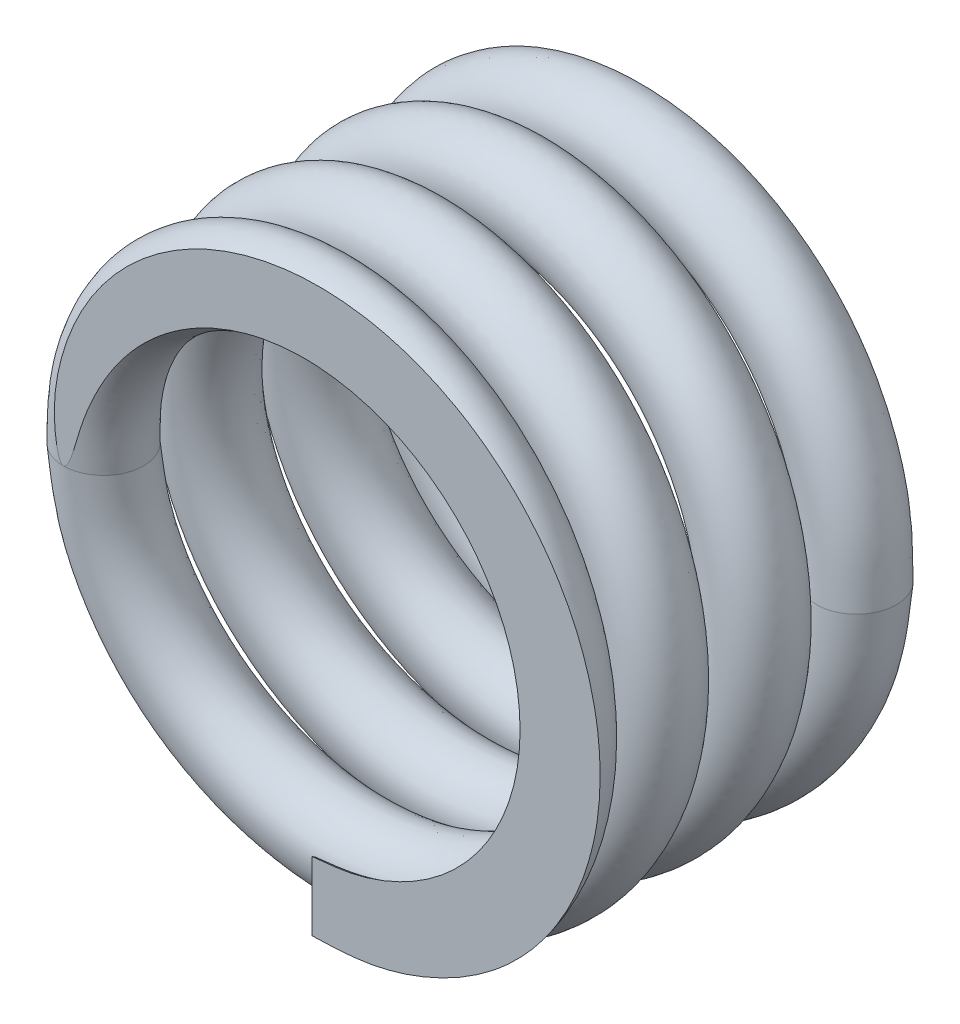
ISO-10303-21;
HEADER;
FILE_DESCRIPTION(('STEP AP214'),'2;1');
FILE_NAME('part.step','',(''),(''),'','','');
FILE_SCHEMA(('AUTOMOTIVE_DESIGN { 1 0 10303 214 1 1 1 1 }'));
ENDSEC;
DATA;
#1=APPLICATION_CONTEXT('core data for automotive mechanical design processes');
#2=APPLICATION_PROTOCOL_DEFINITION('international standard','automotive_design',2000,#1);
#3=PRODUCT_CONTEXT('',#1,'mechanical');
#4=PRODUCT('Part','Part','',(#3));
#5=PRODUCT_RELATED_PRODUCT_CATEGORY('part','',(#4));
#6=PRODUCT_DEFINITION_FORMATION('','',#4);
#7=PRODUCT_DEFINITION_CONTEXT('part definition',#1,'design');
#8=PRODUCT_DEFINITION('design','',#6,#7);
#9=PRODUCT_DEFINITION_SHAPE('','',#8);
#10=(LENGTH_UNIT() NAMED_UNIT(*) SI_UNIT(.MILLI.,.METRE.));
#11=(NAMED_UNIT(*) PLANE_ANGLE_UNIT() SI_UNIT($,.RADIAN.));
#12=(NAMED_UNIT(*) SI_UNIT($,.STERADIAN.) SOLID_ANGLE_UNIT());
#13=UNCERTAINTY_MEASURE_WITH_UNIT(LENGTH_MEASURE(1.E-05),#10,'distance_accuracy_value','');
#14=(GEOMETRIC_REPRESENTATION_CONTEXT(3) GLOBAL_UNCERTAINTY_ASSIGNED_CONTEXT((#13)) GLOBAL_UNIT_ASSIGNED_CONTEXT((#10,
#11,#12)) REPRESENTATION_CONTEXT('',''));
#15=CARTESIAN_POINT('',(0.,0.,0.));
#16=DIRECTION('',(0.,0.,1.));
#17=DIRECTION('',(1.,0.,0.));
#18=AXIS2_PLACEMENT_3D('',#15,#16,#17);
#19=CARTESIAN_POINT('',(-2.04543690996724E-05,-6.50000000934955,9.89359848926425));
#20=DIRECTION('',(0.999999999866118,1.63634948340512E-05,-2.37531958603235E-09));
#21=DIRECTION('',(-1.63634948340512E-05,0.999999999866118,0.));
#22=AXIS2_PLACEMENT_3D('',#19,#20,#21);
#23=PLANE('',#22);
#24=DIRECTION('',(1.63634948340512E-05,-0.999999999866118,0.));
#25=VECTOR('',#24,1.);
#26=CARTESIAN_POINT('',(-2.04558978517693E-05,-6.50000000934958,9.24999999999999));
#27=LINE('',#26,#25);
#28=CARTESIAN_POINT('',(-1.7534813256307E-05,-6.67851227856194,9.24999999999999));
#29=VERTEX_POINT('',#28);
#30=CARTESIAN_POINT('',(1.75317543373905E-05,-8.8214877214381,9.24999999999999));
#31=VERTEX_POINT('',#30);
#32=EDGE_CURVE('E52',#29,#31,#27,.T.);
#33=ORIENTED_EDGE('',*,*,#32,.F.);
#34=CARTESIAN_POINT('',(-3.4747494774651E-13,-7.75,9.89375));
#35=DIRECTION('',(0.999999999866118,1.63634948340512E-05,-2.37531958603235E-09));
#36=DIRECTION('',(-1.63634948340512E-05,0.999999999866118,0.));
#37=AXIS2_PLACEMENT_3D('',#34,#35,#36);
#38=CIRCLE('',#37,1.25);
#39=EDGE_CURVE('E77',#31,#29,#38,.T.);
#40=ORIENTED_EDGE('',*,*,#39,.F.);
#41=EDGE_LOOP('',(#33,#40));
#42=FACE_BOUND('',#41,.T.);
#43=ADVANCED_FACE('F30',(#42),#23,.F.);
#44=CARTESIAN_POINT('',(-8.99999999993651,-1.25979751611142E-05,8.));
#45=CARTESIAN_POINT('',(-8.96600127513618,0.587951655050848,8.02623824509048));
#46=CARTESIAN_POINT('',(-8.89787535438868,1.76610190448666,8.07881388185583));
#47=CARTESIAN_POINT('',(-8.36574500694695,3.46459356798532,8.15792925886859));
#48=CARTESIAN_POINT('',(-7.53211978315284,5.03272626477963,8.23694086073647));
#49=CARTESIAN_POINT('',(-6.40440371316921,6.40569088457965,8.31559967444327));
#50=CARTESIAN_POINT('',(-5.03192925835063,7.53028477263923,8.39453660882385));
#51=CARTESIAN_POINT('',(-3.46674493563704,8.36893662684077,8.47357741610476));
#52=CARTESIAN_POINT('',(-1.76691617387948,8.8830964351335,8.55244740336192));
#53=CARTESIAN_POINT('',(3.53201788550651E-05,9.05847869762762,8.63129656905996));
#54=CARTESIAN_POINT('',(1.76690212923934,8.88298710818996,8.71022218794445));
#55=CARTESIAN_POINT('',(3.46651473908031,8.36897685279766,8.78914836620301));
#56=CARTESIAN_POINT('',(5.03180842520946,7.53065629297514,8.8680483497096));
#57=CARTESIAN_POINT('',(6.4053125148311,6.40533603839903,8.946950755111));
#58=CARTESIAN_POINT('',(7.53063781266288,5.03183608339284,9.02585316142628));
#59=CARTESIAN_POINT('',(8.3689641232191,3.46654547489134,9.10475314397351));
#60=CARTESIAN_POINT('',(8.8829806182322,1.7669347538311,9.18367932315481));
#61=CARTESIAN_POINT('',(9.05847869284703,6.85872297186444E-05,9.26260494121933));
#62=CARTESIAN_POINT('',(8.88310292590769,-1.7668835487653,9.34145410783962));
#63=CARTESIAN_POINT('',(8.36894936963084,-3.46671420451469,9.42032409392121));
#64=CARTESIAN_POINT('',(7.53030325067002,-5.03190160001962,9.4993649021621));
#65=CARTESIAN_POINT('',(6.40571438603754,-6.40438017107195,9.57830183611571));
#66=CARTESIAN_POINT('',(5.03275393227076,-7.53210130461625,9.65696065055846));
#67=CARTESIAN_POINT('',(3.46462430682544,-8.36573232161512,9.73597225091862));
#68=CARTESIAN_POINT('',(1.76613458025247,-8.89786884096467,9.81508762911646));
#69=CARTESIAN_POINT('',(0.587984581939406,-8.96599910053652,9.8676632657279));
#70=CARTESIAN_POINT('',(2.04543684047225E-05,-8.99999999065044,9.89390151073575));
#71=CARTESIAN_POINT('',(-8.9999999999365,-1.25999072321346E-05,10.5));
#72=CARTESIAN_POINT('',(-8.96601444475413,0.587963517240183,10.5262382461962));
#73=CARTESIAN_POINT('',(-8.89791491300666,1.76613753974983,10.5788138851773));
#74=CARTESIAN_POINT('',(-8.3654958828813,3.46443808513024,10.6579292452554));
#75=CARTESIAN_POINT('',(-7.53177103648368,5.03252282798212,10.7369408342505));
#76=CARTESIAN_POINT('',(-6.40446691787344,6.40570792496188,10.8155996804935));
#77=CARTESIAN_POINT('',(-5.03188109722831,7.53028339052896,10.8945366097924));
#78=CARTESIAN_POINT('',(-3.4666827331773,8.36865969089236,10.9735774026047));
#79=CARTESIAN_POINT('',(-1.76685134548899,8.88290350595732,11.0524473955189));
#80=CARTESIAN_POINT('',(-1.8872988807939E-06,9.05838328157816,11.131296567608));
#81=CARTESIAN_POINT('',(1.76690753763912,8.8828481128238,11.2102221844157));
#82=CARTESIAN_POINT('',(3.46640926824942,8.36883419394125,11.2891483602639));
#83=CARTESIAN_POINT('',(5.03174502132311,7.53050728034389,11.3680483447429));
#84=CARTESIAN_POINT('',(6.40517644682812,6.4052564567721,11.4469507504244));
#85=CARTESIAN_POINT('',(7.53053324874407,5.03173005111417,11.5258531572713));
#86=CARTESIAN_POINT('',(8.36882502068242,3.46653423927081,11.604753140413));
#87=CARTESIAN_POINT('',(8.8828204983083,1.76686985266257,11.6836793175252));
#88=CARTESIAN_POINT('',(9.05826913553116,0.000105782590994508,11.7626049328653));
#89=CARTESIAN_POINT('',(8.88299673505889,-1.76688889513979,11.8414541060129));
#90=CARTESIAN_POINT('',(8.36894455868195,-3.4666596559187,11.9203240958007));
#91=CARTESIAN_POINT('',(7.53005108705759,-5.03178028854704,11.9993648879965));
#92=CARTESIAN_POINT('',(6.40548160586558,-6.40410143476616,12.0783018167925));
#93=CARTESIAN_POINT('',(5.03278783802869,-7.53219646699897,12.1569606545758));
#94=CARTESIAN_POINT('',(3.46466342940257,-8.3656996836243,12.235972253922));
#95=CARTESIAN_POINT('',(1.76603933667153,-8.89752968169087,12.3150876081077));
#96=CARTESIAN_POINT('',(0.587952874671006,-8.96568404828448,12.3676632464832));
#97=CARTESIAN_POINT('',(2.04553482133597E-05,-8.99969696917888,12.3939014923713));
#98=CARTESIAN_POINT('',(-6.50000000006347,1.25960436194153E-05,10.5));
#99=CARTESIAN_POINT('',(-6.47540796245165,0.424269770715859,10.5262546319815));
#100=CARTESIAN_POINT('',(-6.42613096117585,1.2743872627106,10.5788631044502));
#101=CARTESIAN_POINT('',(-6.0408784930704,2.50446855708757,10.6576406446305));
#102=CARTESIAN_POINT('',(-5.43962122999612,3.63387866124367,10.7365376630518));
#103=CARTESIAN_POINT('',(-4.62625584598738,4.62582629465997,10.815657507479));
#104=CARTESIAN_POINT('',(-3.63366378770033,5.43848870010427,10.8945099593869));
#105=CARTESIAN_POINT('',(-2.50342772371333,6.04419279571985,10.9732990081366));
#106=CARTESIAN_POINT('',(-1.27607778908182,6.41509788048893,11.0522462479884));
#107=CARTESIAN_POINT('',(-6.85834378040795E-05,6.54227969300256,11.1312020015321));
#108=CARTESIAN_POINT('',(1.27611051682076,6.41506856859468,11.2100880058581));
#109=CARTESIAN_POINT('',(2.50358372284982,6.04422223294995,11.2889772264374));
#110=CARTESIAN_POINT('',(3.63388358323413,5.43842129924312,11.3678901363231));
#111=CARTESIAN_POINT('',(4.62603867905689,4.62607164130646,11.4467992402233));
#112=CARTESIAN_POINT('',(5.43848422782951,3.63381329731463,11.5257083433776));
#113=CARTESIAN_POINT('',(6.04423851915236,2.50364722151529,11.6046212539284));
#114=CARTESIAN_POINT('',(6.41505393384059,1.27600758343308,11.6835104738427));
#115=CARTESIAN_POINT('',(6.5421655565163,-2.74484288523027E-05,11.7623964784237));
#116=CARTESIAN_POINT('',(6.41517812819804,-1.27618058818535,11.8413522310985));
#117=CARTESIAN_POINT('',(6.04445217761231,-2.50346610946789,11.9202994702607));
#118=CARTESIAN_POINT('',(5.43821944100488,-3.63361829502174,11.9990885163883));
#119=CARTESIAN_POINT('',(4.62555297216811,-4.62593744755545,12.077940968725));
#120=CARTESIAN_POINT('',(3.63408833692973,-5.44008361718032,12.1570608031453));
#121=CARTESIAN_POINT('',(2.50463242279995,-6.04110766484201,12.2359578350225));
#122=CARTESIAN_POINT('',(1.27422370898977,-6.42575875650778,12.3147353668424));
#123=CARTESIAN_POINT('',(0.424193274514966,-6.4750819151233,12.367343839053));
#124=CARTESIAN_POINT('',(-2.04533892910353E-05,-6.49969698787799,12.3935984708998));
#125=CARTESIAN_POINT('',(-6.50000000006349,1.25979756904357E-05,8.));
#126=CARTESIAN_POINT('',(-6.47539479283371,0.424257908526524,8.02625463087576));
#127=CARTESIAN_POINT('',(-6.42609140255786,1.27435162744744,8.07886310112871));
#128=CARTESIAN_POINT('',(-6.04112761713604,2.50462403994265,8.15764065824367));
#129=CARTESIAN_POINT('',(-5.43996997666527,3.63408209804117,8.23653768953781));
#130=CARTESIAN_POINT('',(-4.62619264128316,4.62580925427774,8.31565750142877));
#131=CARTESIAN_POINT('',(-3.63371194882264,5.43849008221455,8.39450995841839));
#132=CARTESIAN_POINT('',(-2.50348992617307,6.04446973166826,8.47329902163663));
#133=CARTESIAN_POINT('',(-1.2761426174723,6.41529080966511,8.55224625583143));
#134=CARTESIAN_POINT('',(-3.13759600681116E-05,6.54237510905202,8.63120200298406));
#135=CARTESIAN_POINT('',(1.27610510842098,6.41520756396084,8.71008800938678));
#136=CARTESIAN_POINT('',(2.5036891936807,6.04436489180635,8.78897723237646));
#137=CARTESIAN_POINT('',(3.63394698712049,5.43857031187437,8.86789014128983));
#138=CARTESIAN_POINT('',(4.62617474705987,4.62615122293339,8.94679924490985));
#139=CARTESIAN_POINT('',(5.43858879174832,3.63391932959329,9.02570834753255));
#140=CARTESIAN_POINT('',(6.04437762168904,2.50365845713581,9.10462125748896));
#141=CARTESIAN_POINT('',(6.4152140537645,1.27607248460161,9.18351047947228));
#142=CARTESIAN_POINT('',(6.54237511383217,-6.46437901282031E-05,9.2623964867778));
#143=CARTESIAN_POINT('',(6.41528431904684,-1.27617524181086,9.34135223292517));
#144=CARTESIAN_POINT('',(6.0444569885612,-2.50352065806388,9.42029946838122));
#145=CARTESIAN_POINT('',(5.43847160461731,-3.63373960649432,9.49908853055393));
#146=CARTESIAN_POINT('',(4.62578575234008,-4.62621618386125,9.57794098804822));
#147=CARTESIAN_POINT('',(3.6340544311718,-5.43998845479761,9.65706079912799));
#148=CARTESIAN_POINT('',(2.50459330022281,-6.04114030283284,9.73595783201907));
#149=CARTESIAN_POINT('',(1.27431895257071,-6.42609791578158,9.81473538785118));
#150=CARTESIAN_POINT('',(0.424224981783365,-6.47539696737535,9.86734385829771));
#151=CARTESIAN_POINT('',(-2.04543690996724E-05,-6.50000000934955,9.89359848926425));
#152=CARTESIAN_POINT('',(-6.50000000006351,1.25999077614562E-05,5.50000000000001));
#153=CARTESIAN_POINT('',(-6.47538162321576,0.424246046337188,5.52625462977));
#154=CARTESIAN_POINT('',(-6.42605184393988,1.27431599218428,5.57886309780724));
#155=CARTESIAN_POINT('',(-6.04137674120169,2.50477952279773,5.65764067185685));
#156=CARTESIAN_POINT('',(-5.44031872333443,3.63428553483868,5.7365377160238));
#157=CARTESIAN_POINT('',(-4.62612943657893,4.62579221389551,5.81565749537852));
#158=CARTESIAN_POINT('',(-3.63376010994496,5.43849146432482,5.89450995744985));
#159=CARTESIAN_POINT('',(-2.50355212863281,6.04474666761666,5.97329903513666));
#160=CARTESIAN_POINT('',(-1.27620744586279,6.41548373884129,6.05224626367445));
#161=CARTESIAN_POINT('',(5.83151766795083E-06,6.54247052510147,6.13120200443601));
#162=CARTESIAN_POINT('',(1.2760997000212,6.41534655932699,6.21008801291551));
#163=CARTESIAN_POINT('',(2.50379466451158,6.04450755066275,6.28897723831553));
#164=CARTESIAN_POINT('',(3.63401039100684,5.43871932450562,6.36789014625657));
#165=CARTESIAN_POINT('',(4.62631081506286,4.62623080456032,6.44679924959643));
#166=CARTESIAN_POINT('',(5.43869335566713,3.63402536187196,6.52570835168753));
#167=CARTESIAN_POINT('',(6.04451672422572,2.50366969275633,6.60462126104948));
#168=CARTESIAN_POINT('',(6.4153741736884,1.27613738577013,6.68351048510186));
#169=CARTESIAN_POINT('',(6.54258467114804,-0.000101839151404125,6.76239649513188));
#170=CARTESIAN_POINT('',(6.41539050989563,-1.27616989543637,6.84135223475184));
#171=CARTESIAN_POINT('',(6.04446179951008,-2.50357520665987,6.92029946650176));
#172=CARTESIAN_POINT('',(5.43872376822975,-3.6338609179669,6.99908854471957));
#173=CARTESIAN_POINT('',(4.62601853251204,-4.62649492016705,7.07794100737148));
#174=CARTESIAN_POINT('',(3.63402052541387,-5.4398932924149,7.15706079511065));
#175=CARTESIAN_POINT('',(2.50455417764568,-6.04117294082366,7.23595782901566));
#176=CARTESIAN_POINT('',(1.27441419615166,-6.42643707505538,7.31473540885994));
#177=CARTESIAN_POINT('',(0.424256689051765,-6.47571201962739,7.36734387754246));
#178=CARTESIAN_POINT('',(-2.04553489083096E-05,-6.50030303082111,7.39359850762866));
#179=CARTESIAN_POINT('',(-8.99999999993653,-1.25960430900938E-05,5.50000000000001));
#180=CARTESIAN_POINT('',(-8.96598810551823,0.587939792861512,5.52623824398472));
#181=CARTESIAN_POINT('',(-8.8978357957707,1.7660662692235,5.57881387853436));
#182=CARTESIAN_POINT('',(-8.36599413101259,3.4647490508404,5.65792927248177));
#183=CARTESIAN_POINT('',(-7.53246852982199,5.03292970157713,5.73694088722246));
#184=CARTESIAN_POINT('',(-6.40434050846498,6.40567384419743,5.81559966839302));
#185=CARTESIAN_POINT('',(-5.03197741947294,7.5302861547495,5.89453660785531));
#186=CARTESIAN_POINT('',(-3.46680713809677,8.36921356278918,5.97357742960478));
#187=CARTESIAN_POINT('',(-1.76698100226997,8.88328936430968,6.05244741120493));
#188=CARTESIAN_POINT('',(7.25276565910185E-05,9.05857411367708,6.13129657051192));
#189=CARTESIAN_POINT('',(1.76689672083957,8.88312610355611,6.21022219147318));
#190=CARTESIAN_POINT('',(3.46662020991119,8.36911951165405,6.28914837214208));
#191=CARTESIAN_POINT('',(5.03187182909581,7.53080530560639,6.36804835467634));
#192=CARTESIAN_POINT('',(6.40544858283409,6.40541562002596,6.44695075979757));
#193=CARTESIAN_POINT('',(7.53074237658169,5.0319421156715,6.52585316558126));
#194=CARTESIAN_POINT('',(8.36910322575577,3.46655671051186,6.60475314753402));
#195=CARTESIAN_POINT('',(8.8831407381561,1.76699965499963,6.68367932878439));
#196=CARTESIAN_POINT('',(9.05868825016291,3.13918684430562E-05,6.76260494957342));
#197=CARTESIAN_POINT('',(8.88320911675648,-1.7668782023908,6.84145410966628));
#198=CARTESIAN_POINT('',(8.36895418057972,-3.46676875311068,6.92032409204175));
#199=CARTESIAN_POINT('',(7.53055541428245,-5.0320229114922,6.99936491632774));
#200=CARTESIAN_POINT('',(6.40594716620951,-6.40465890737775,7.07830185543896));
#201=CARTESIAN_POINT('',(5.03272002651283,-7.53200614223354,7.15696064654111));
#202=CARTESIAN_POINT('',(3.46458518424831,-8.36576495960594,7.23597224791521));
#203=CARTESIAN_POINT('',(1.76622982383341,-8.89820800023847,7.31508765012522));
#204=CARTESIAN_POINT('',(0.588016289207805,-8.96631415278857,7.36766328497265));
#205=CARTESIAN_POINT('',(2.04533885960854E-05,-9.000303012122,7.39390152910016));
#206=CARTESIAN_POINT('',(-8.99999999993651,-1.25979751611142E-05,8.));
#207=CARTESIAN_POINT('',(-8.96600127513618,0.587951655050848,8.02623824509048));
#208=CARTESIAN_POINT('',(-8.89787535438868,1.76610190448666,8.07881388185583));
#209=CARTESIAN_POINT('',(-8.36574500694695,3.46459356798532,8.15792925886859));
#210=CARTESIAN_POINT('',(-7.53211978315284,5.03272626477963,8.23694086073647));
#211=CARTESIAN_POINT('',(-6.40440371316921,6.40569088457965,8.31559967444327));
#212=CARTESIAN_POINT('',(-5.03192925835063,7.53028477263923,8.39453660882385));
#213=CARTESIAN_POINT('',(-3.46674493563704,8.36893662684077,8.47357741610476));
#214=CARTESIAN_POINT('',(-1.76691617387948,8.8830964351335,8.55244740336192));
#215=CARTESIAN_POINT('',(3.53201788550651E-05,9.05847869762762,8.63129656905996));
#216=CARTESIAN_POINT('',(1.76690212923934,8.88298710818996,8.71022218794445));
#217=CARTESIAN_POINT('',(3.46651473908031,8.36897685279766,8.78914836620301));
#218=CARTESIAN_POINT('',(5.03180842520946,7.53065629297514,8.8680483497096));
#219=CARTESIAN_POINT('',(6.4053125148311,6.40533603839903,8.946950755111));
#220=CARTESIAN_POINT('',(7.53063781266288,5.03183608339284,9.02585316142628));
#221=CARTESIAN_POINT('',(8.3689641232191,3.46654547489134,9.10475314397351));
#222=CARTESIAN_POINT('',(8.8829806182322,1.7669347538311,9.18367932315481));
#223=CARTESIAN_POINT('',(9.05847869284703,6.85872297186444E-05,9.26260494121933));
#224=CARTESIAN_POINT('',(8.88310292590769,-1.7668835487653,9.34145410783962));
#225=CARTESIAN_POINT('',(8.36894936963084,-3.46671420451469,9.42032409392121));
#226=CARTESIAN_POINT('',(7.53030325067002,-5.03190160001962,9.4993649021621));
#227=CARTESIAN_POINT('',(6.40571438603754,-6.40438017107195,9.57830183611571));
#228=CARTESIAN_POINT('',(5.03275393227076,-7.53210130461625,9.65696065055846));
#229=CARTESIAN_POINT('',(3.46462430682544,-8.36573232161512,9.73597225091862));
#230=CARTESIAN_POINT('',(1.76613458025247,-8.89786884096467,9.81508762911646));
#231=CARTESIAN_POINT('',(0.587984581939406,-8.96599910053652,9.8676632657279));
#232=CARTESIAN_POINT('',(2.04543684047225E-05,-8.99999999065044,9.89390151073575));
#233=(BOUNDED_SURFACE() B_SPLINE_SURFACE(3,3,((#44,#45,#46,#47,#48,#49,#50,#51,#52,#53,#54,#55,
#56,#57,#58,#59,#60,#61,#62,#63,#64,#65,#66,#67,#68,#69,#70),(#71,#72,#73,#74,#75,#76,#77,#78,
#79,#80,#81,#82,#83,#84,#85,#86,#87,#88,#89,#90,#91,#92,#93,#94,#95,#96,#97),(#98,#99,#100,#101,
#102,#103,#104,#105,#106,#107,#108,#109,#110,#111,#112,#113,#114,#115,#116,#117,#118,#119,#120,
#121,#122,#123,#124),(#125,#126,#127,#128,#129,#130,#131,#132,#133,#134,#135,#136,#137,#138,
#139,#140,#141,#142,#143,#144,#145,#146,#147,#148,#149,#150,#151),(#152,#153,#154,#155,#156,
#157,#158,#159,#160,#161,#162,#163,#164,#165,#166,#167,#168,#169,#170,#171,#172,#173,#174,#175,
#176,#177,#178),(#179,#180,#181,#182,#183,#184,#185,#186,#187,#188,#189,#190,#191,#192,#193,
#194,#195,#196,#197,#198,#199,#200,#201,#202,#203,#204,#205),(#206,#207,#208,#209,#210,#211,
#212,#213,#214,#215,#216,#217,#218,#219,#220,#221,#222,#223,#224,#225,#226,#227,#228,#229,#230,
#231,#232)),.UNSPECIFIED.,.T.,.F.,.F.) B_SPLINE_SURFACE_WITH_KNOTS((4,3,4),(4,1,1,1,1,1,1,1,1,1,
1,1,1,1,1,1,1,1,1,1,1,1,1,1,4),(0.,0.5,1.),(0.,0.0415851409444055,0.0833274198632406,
0.125017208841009,0.166667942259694,0.208329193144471,0.249998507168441,0.291666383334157,
0.333333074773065,0.374999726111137,0.416666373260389,0.458333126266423,0.50000000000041,
0.541666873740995,0.583333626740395,0.625000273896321,0.666666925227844,0.708333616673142,
0.750001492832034,0.791670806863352,0.833332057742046,0.874982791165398,0.916672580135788,
0.958414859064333,1.),
.UNSPECIFIED.) GEOMETRIC_REPRESENTATION_ITEM() RATIONAL_B_SPLINE_SURFACE(((1.,1.,1.,1.,1.,1.,1.,
1.,1.,1.,1.,1.,1.,1.,1.,1.,1.,1.,1.,1.,1.,1.,1.,1.,1.,1.,1.),(0.333333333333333,
0.333333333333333,0.333333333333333,0.333333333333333,0.333333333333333,0.333333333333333,
0.333333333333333,0.333333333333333,0.333333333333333,0.333333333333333,0.333333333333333,
0.333333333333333,0.333333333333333,0.333333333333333,0.333333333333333,0.333333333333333,
0.333333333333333,0.333333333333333,0.333333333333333,0.333333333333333,0.333333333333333,
0.333333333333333,0.333333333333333,0.333333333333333,0.333333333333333,0.333333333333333,
0.333333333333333),(0.333333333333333,0.333333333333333,0.333333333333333,0.333333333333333,
0.333333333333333,0.333333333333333,0.333333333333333,0.333333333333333,0.333333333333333,
0.333333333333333,0.333333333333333,0.333333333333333,0.333333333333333,0.333333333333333,
0.333333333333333,0.333333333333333,0.333333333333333,0.333333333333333,0.333333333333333,
0.333333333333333,0.333333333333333,0.333333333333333,0.333333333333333,0.333333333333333,
0.333333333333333,0.333333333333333,0.333333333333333),(1.,1.,1.,1.,1.,1.,1.,1.,1.,1.,1.,1.,1.,
1.,1.,1.,1.,1.,1.,1.,1.,1.,1.,1.,1.,1.,1.),(0.333333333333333,0.333333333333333,
0.333333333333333,0.333333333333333,0.333333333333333,0.333333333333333,0.333333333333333,
0.333333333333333,0.333333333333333,0.333333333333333,0.333333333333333,0.333333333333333,
0.333333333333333,0.333333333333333,0.333333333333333,0.333333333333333,0.333333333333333,
0.333333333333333,0.333333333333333,0.333333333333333,0.333333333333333,0.333333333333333,
0.333333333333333,0.333333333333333,0.333333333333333,0.333333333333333,0.333333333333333),
(0.333333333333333,0.333333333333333,0.333333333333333,0.333333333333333,0.333333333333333,
0.333333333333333,0.333333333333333,0.333333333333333,0.333333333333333,0.333333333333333,
0.333333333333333,0.333333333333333,0.333333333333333,0.333333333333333,0.333333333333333,
0.333333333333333,0.333333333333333,0.333333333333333,0.333333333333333,0.333333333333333,
0.333333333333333,0.333333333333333,0.333333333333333,0.333333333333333,0.333333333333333,
0.333333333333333,0.333333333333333),(1.,1.,1.,1.,1.,1.,1.,1.,1.,1.,1.,1.,1.,1.,1.,1.,1.,1.,1.,
1.,1.,1.,1.,1.,1.,1.,1.))) REPRESENTATION_ITEM('') SURFACE());
#234=CARTESIAN_POINT('',(-1.7534813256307E-05,-6.67851227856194,9.24999999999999));
#235=CARTESIAN_POINT('',(0.139000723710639,-6.66540767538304,9.24999999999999));
#236=CARTESIAN_POINT('',(0.278128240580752,-6.6524455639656,9.24999999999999));
#237=CARTESIAN_POINT('',(0.556290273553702,-6.62322798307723,9.24999999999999));
#238=CARTESIAN_POINT('',(0.695324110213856,-6.6069663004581,9.24999999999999));
#239=CARTESIAN_POINT('',(0.903130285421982,-6.57744298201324,9.24999999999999));
#240=CARTESIAN_POINT('',(0.972254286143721,-6.56675072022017,9.24999999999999));
#241=CARTESIAN_POINT('',(1.11013627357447,-6.54322516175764,9.24999999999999));
#242=CARTESIAN_POINT('',(1.17889428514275,-6.53039201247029,9.24999999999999));
#243=CARTESIAN_POINT('',(1.31596424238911,-6.50209181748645,9.24999999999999));
#244=CARTESIAN_POINT('',(1.38427548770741,-6.48662135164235,9.24999999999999));
#245=CARTESIAN_POINT('',(1.5202639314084,-6.45310778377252,9.24999999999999));
#246=CARTESIAN_POINT('',(1.58794108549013,-6.43506450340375,9.24999999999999));
#247=CARTESIAN_POINT('',(1.78982795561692,-6.37735837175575,9.24999999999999));
#248=CARTESIAN_POINT('',(1.92302134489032,-6.33409228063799,9.24999999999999));
#249=CARTESIAN_POINT('',(2.18629950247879,-6.23897557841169,9.24999999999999));
#250=CARTESIAN_POINT('',(2.31638371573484,-6.18712344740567,9.24999999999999));
#251=CARTESIAN_POINT('',(2.54207311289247,-6.0893075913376,9.24999999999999));
#252=CARTESIAN_POINT('',(2.63838625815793,-6.04496747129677,9.24999999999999));
#253=CARTESIAN_POINT('',(2.82892466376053,-5.95200644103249,9.24999999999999));
#254=CARTESIAN_POINT('',(2.92314980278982,-5.90338528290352,9.24999999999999));
#255=CARTESIAN_POINT('',(3.20236730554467,-5.75107242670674,9.24999999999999));
#256=CARTESIAN_POINT('',(3.38390540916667,-5.64092976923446,9.24999999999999));
#257=CARTESIAN_POINT('',(3.73547846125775,-5.40392444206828,9.24999999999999));
#258=CARTESIAN_POINT('',(3.90552236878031,-5.27707502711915,9.24999999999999));
#259=CARTESIAN_POINT('',(4.23274613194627,-5.00781241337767,9.24999999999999));
#260=CARTESIAN_POINT('',(4.38992951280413,-4.86540350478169,9.25));
#261=CARTESIAN_POINT('',(4.67515552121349,-4.58098558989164,9.25));
#262=CARTESIAN_POINT('',(4.80454328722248,-4.44032178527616,9.24999999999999));
#263=CARTESIAN_POINT('',(5.05081349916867,-4.14844428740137,9.24999999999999));
#264=CARTESIAN_POINT('',(5.16769610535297,-3.99723072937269,9.24999999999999));
#265=CARTESIAN_POINT('',(5.38819398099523,-3.68542432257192,9.24999999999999));
#266=CARTESIAN_POINT('',(5.49180920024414,-3.52483143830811,9.24999999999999));
#267=CARTESIAN_POINT('',(5.68497198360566,-3.19540987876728,9.24999999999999));
#268=CARTESIAN_POINT('',(5.77452080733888,-3.02658194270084,9.24999999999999));
#269=CARTESIAN_POINT('',(5.93751783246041,-2.68426596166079,9.24999999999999));
#270=CARTESIAN_POINT('',(6.01117717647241,-2.5108785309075,9.24999999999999));
#271=CARTESIAN_POINT('',(6.14331443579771,-2.15840679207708,9.24999999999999));
#272=CARTESIAN_POINT('',(6.20179175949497,-1.97932226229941,9.24999999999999));
#273=CARTESIAN_POINT('',(6.30337751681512,-1.61688384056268,9.24999999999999));
#274=CARTESIAN_POINT('',(6.34648841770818,-1.43353063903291,9.24999999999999));
#275=CARTESIAN_POINT('',(6.41710855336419,-1.06384477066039,9.24999999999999));
#276=CARTESIAN_POINT('',(6.44461791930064,-0.877512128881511,9.25));
#277=CARTESIAN_POINT('',(6.48359868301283,-0.504744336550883,9.25));
#278=CARTESIAN_POINT('',(6.49520206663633,-0.318323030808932,9.24999999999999));
#279=CARTESIAN_POINT('',(6.5024421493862,0.0548242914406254,9.24999999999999));
#280=CARTESIAN_POINT('',(6.49807955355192,0.241550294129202,9.24999999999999));
#281=CARTESIAN_POINT('',(6.47357092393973,0.613951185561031,9.24999999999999));
#282=CARTESIAN_POINT('',(6.45342531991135,0.799626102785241,9.25));
#283=CARTESIAN_POINT('',(6.39767984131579,1.16865284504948,9.24999999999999));
#284=CARTESIAN_POINT('',(6.3620787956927,1.35200449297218,9.24999999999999));
#285=CARTESIAN_POINT('',(6.27573310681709,1.7148512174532,9.24999999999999));
#286=CARTESIAN_POINT('',(6.2250086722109,1.89435109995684,9.24999999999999));
#287=CARTESIAN_POINT('',(6.10859702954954,2.24841824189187,9.25));
#288=CARTESIAN_POINT('',(6.04291138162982,2.42298601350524,9.24999999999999));
#289=CARTESIAN_POINT('',(5.89690839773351,2.76588233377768,9.24999999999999));
#290=CARTESIAN_POINT('',(5.81659151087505,2.93421107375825,9.24999999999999));
#291=CARTESIAN_POINT('',(5.64214863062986,3.26357074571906,9.25));
#292=CARTESIAN_POINT('',(5.54802104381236,3.42460083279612,9.25));
#293=CARTESIAN_POINT('',(5.34660999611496,3.73842551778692,9.25));
#294=CARTESIAN_POINT('',(5.23931421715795,3.89121220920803,9.25));
#295=CARTESIAN_POINT('',(5.01236516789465,4.18729440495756,9.24999999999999));
#296=CARTESIAN_POINT('',(4.89271323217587,4.33059093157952,9.24999999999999));
#297=CARTESIAN_POINT('',(4.64170094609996,4.60654850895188,9.24999999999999));
#298=CARTESIAN_POINT('',(4.51034014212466,4.73920914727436,9.24999999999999));
#299=CARTESIAN_POINT('',(4.23691618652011,4.99301439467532,9.24999999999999));
#300=CARTESIAN_POINT('',(4.09485209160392,5.11415798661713,9.24999999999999));
#301=CARTESIAN_POINT('',(3.80046297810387,5.34482722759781,9.24999999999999));
#302=CARTESIAN_POINT('',(3.64809104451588,5.45429297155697,9.24999999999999));
#303=CARTESIAN_POINT('',(3.33480171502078,5.66020755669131,9.24999999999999));
#304=CARTESIAN_POINT('',(3.17388471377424,5.75665699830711,9.24999999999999));
#305=CARTESIAN_POINT('',(2.84454846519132,5.93580418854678,9.24999999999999));
#306=CARTESIAN_POINT('',(2.67612870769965,6.01850100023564,9.25));
#307=CARTESIAN_POINT('',(2.33290863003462,6.16937994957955,9.24999999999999));
#308=CARTESIAN_POINT('',(2.15810824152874,6.2375619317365,9.24999999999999));
#309=CARTESIAN_POINT('',(1.80190444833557,6.35973780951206,9.24999999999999));
#310=CARTESIAN_POINT('',(1.62045647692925,6.41360158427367,9.24999999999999));
#311=CARTESIAN_POINT('',(1.25372345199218,6.50614169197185,9.25));
#312=CARTESIAN_POINT('',(1.06843823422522,6.54481737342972,9.24999999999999));
#313=CARTESIAN_POINT('',(0.695290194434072,6.60674809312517,9.24999999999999));
#314=CARTESIAN_POINT('',(0.507427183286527,6.63000199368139,9.24999999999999));
#315=CARTESIAN_POINT('',(0.130430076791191,6.66075813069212,9.24999999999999));
#316=CARTESIAN_POINT('',(-0.0587039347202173,6.66826139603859,9.24999999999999));
#317=CARTESIAN_POINT('',(-0.439566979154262,6.66748499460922,9.24999999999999));
#318=CARTESIAN_POINT('',(-0.631295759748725,6.65898582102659,9.24999999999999));
#319=CARTESIAN_POINT('',(-1.01333807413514,6.62618199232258,9.24999999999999));
#320=CARTESIAN_POINT('',(-1.20365146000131,6.60187570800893,9.24999999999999));
#321=CARTESIAN_POINT('',(-1.77069561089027,6.50560740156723,9.24999999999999));
#322=CARTESIAN_POINT('',(-2.14385727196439,6.41029438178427,9.25));
#323=CARTESIAN_POINT('',(-2.69093090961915,6.22116821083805,9.25));
#324=CARTESIAN_POINT('',(-2.87287664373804,6.14950614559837,9.24999999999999));
#325=CARTESIAN_POINT('',(-3.23022221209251,5.99137138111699,9.24999999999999));
#326=CARTESIAN_POINT('',(-3.40562153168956,5.90489752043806,9.24999999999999));
#327=CARTESIAN_POINT('',(-3.92039973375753,5.62447373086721,9.24999999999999));
#328=CARTESIAN_POINT('',(-4.24866897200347,5.40941298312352,9.24999999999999));
#329=CARTESIAN_POINT('',(-4.71624584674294,5.04648105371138,9.24999999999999));
#330=CARTESIAN_POINT('',(-4.86998622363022,4.9166067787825,9.24999999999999));
#331=CARTESIAN_POINT('',(-5.16632191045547,4.64464815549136,9.24999999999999));
#332=CARTESIAN_POINT('',(-5.30891828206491,4.50256497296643,9.24999999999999));
#333=CARTESIAN_POINT('',(-5.58222083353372,4.20740926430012,9.24999999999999));
#334=CARTESIAN_POINT('',(-5.71292618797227,4.05433597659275,9.24999999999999));
#335=CARTESIAN_POINT('',(-5.96178738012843,3.73824028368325,9.25));
#336=CARTESIAN_POINT('',(-6.07994050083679,3.57521573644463,9.25));
#337=CARTESIAN_POINT('',(-6.25031458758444,3.3205815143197,9.25));
#338=CARTESIAN_POINT('',(-6.30710868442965,3.23198761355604,9.24999999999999));
#339=CARTESIAN_POINT('',(-6.41731065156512,3.05271108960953,9.24999999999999));
#340=CARTESIAN_POINT('',(-6.47071847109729,2.96202843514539,9.24999999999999));
#341=CARTESIAN_POINT('',(-6.57422765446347,2.77882390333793,9.24999999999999));
#342=CARTESIAN_POINT('',(-6.62432969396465,2.68630240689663,9.24999999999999));
#343=CARTESIAN_POINT('',(-6.72120631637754,2.49952937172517,9.24999999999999));
#344=CARTESIAN_POINT('',(-6.76798083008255,2.40527779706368,9.24999999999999));
#345=CARTESIAN_POINT('',(-6.8579841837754,2.21516329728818,9.24999999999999));
#346=CARTESIAN_POINT('',(-6.90121511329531,2.11930136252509,9.24999999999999));
#347=CARTESIAN_POINT('',(-6.9840193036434,1.92602135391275,9.24999999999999));
#348=CARTESIAN_POINT('',(-7.02359291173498,1.82860342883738,9.24999999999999));
#349=CARTESIAN_POINT('',(-7.09900388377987,1.63234170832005,9.24999999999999));
#350=CARTESIAN_POINT('',(-7.13484165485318,1.5334980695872,9.24999999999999));
#351=CARTESIAN_POINT('',(-7.20278473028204,1.33454152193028,9.24999999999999));
#352=CARTESIAN_POINT('',(-7.23488983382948,1.23442854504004,9.24999999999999));
#353=CARTESIAN_POINT('',(-7.28154946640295,1.08381201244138,9.24999999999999));
#354=CARTESIAN_POINT('',(-7.29685258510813,1.03353345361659,9.25));
#355=CARTESIAN_POINT('',(-7.32724308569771,0.932914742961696,9.24999999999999));
#356=CARTESIAN_POINT('',(-7.34233048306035,0.882574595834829,9.24999999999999));
#357=CARTESIAN_POINT('',(-7.37261791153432,0.781921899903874,9.25));
#358=CARTESIAN_POINT('',(-7.38781795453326,0.731609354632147,9.25000000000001));
#359=CARTESIAN_POINT('',(-7.41875523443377,0.631151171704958,9.24999999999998));
#360=CARTESIAN_POINT('',(-7.43449245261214,0.581005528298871,9.24999999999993));
#361=CARTESIAN_POINT('',(-7.4674492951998,0.479972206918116,9.24999999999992));
#362=CARTESIAN_POINT('',(-7.48469388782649,0.429092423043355,9.24999999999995));
#363=CARTESIAN_POINT('',(-7.51226150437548,0.353406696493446,9.25000000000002));
#364=CARTESIAN_POINT('',(-7.5217308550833,0.328291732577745,9.25000000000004));
#365=CARTESIAN_POINT('',(-7.54147925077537,0.278376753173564,9.24999999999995));
#366=CARTESIAN_POINT('',(-7.55175828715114,0.253576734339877,9.24999999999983));
#367=CARTESIAN_POINT('',(-7.56927585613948,0.214047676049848,9.24999999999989));
#368=CARTESIAN_POINT('',(-7.57614155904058,0.199154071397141,9.24999999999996));
#369=CARTESIAN_POINT('',(-7.59045808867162,0.169652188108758,9.25000000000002));
#370=CARTESIAN_POINT('',(-7.59790874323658,0.155043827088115,9.25000000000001));
#371=CARTESIAN_POINT('',(-7.61268544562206,0.127960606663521,9.24999999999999));
#372=CARTESIAN_POINT('',(-7.61992234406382,0.115437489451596,9.24999999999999));
#373=CARTESIAN_POINT('',(-7.63527244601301,0.0909001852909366,9.24999999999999));
#374=CARTESIAN_POINT('',(-7.64338685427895,0.0788867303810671,9.24999999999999));
#375=CARTESIAN_POINT('',(-7.65855828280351,0.0588996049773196,9.24999999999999));
#376=CARTESIAN_POINT('',(-7.66531811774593,0.0507044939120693,9.25));
#377=CARTESIAN_POINT('',(-7.67978073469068,0.0352177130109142,9.24999999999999));
#378=CARTESIAN_POINT('',(-7.68747986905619,0.027922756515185,9.24999999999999));
#379=CARTESIAN_POINT('',(-7.70356276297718,0.0154918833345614,9.24999999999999));
#380=CARTESIAN_POINT('',(-7.7118412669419,0.0102293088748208,9.25));
#381=CARTESIAN_POINT('',(-7.72846316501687,0.00310263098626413,9.24999999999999));
#382=CARTESIAN_POINT('',(-7.73661874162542,0.000853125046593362,9.24999999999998));
#383=CARTESIAN_POINT('',(-7.74908199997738,-0.000130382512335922,9.25));
#384=CARTESIAN_POINT('',(-7.75329824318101,-5.27095997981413E-05,9.25000000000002));
#385=CARTESIAN_POINT('',(-7.76163619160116,0.000919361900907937,9.24999999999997));
#386=CARTESIAN_POINT('',(-7.76575784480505,0.00181419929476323,9.24999999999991));
#387=CARTESIAN_POINT('',(-7.77842841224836,0.00580292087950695,9.24999999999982));
#388=CARTESIAN_POINT('',(-7.7865500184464,0.0102439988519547,9.24999999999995));
#389=CARTESIAN_POINT('',(-7.80005738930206,0.0200435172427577,9.25000000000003));
#390=CARTESIAN_POINT('',(-7.80567354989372,0.0251228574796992,9.25));
#391=CARTESIAN_POINT('',(-7.81615602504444,0.0360232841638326,9.24999999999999));
#392=CARTESIAN_POINT('',(-7.82102017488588,0.0418464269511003,9.24999999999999));
#393=CARTESIAN_POINT('',(-7.8324455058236,0.0569647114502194,9.25));
#394=CARTESIAN_POINT('',(-7.83863255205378,0.0665351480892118,9.25000000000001));
#395=CARTESIAN_POINT('',(-7.8500938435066,0.0861822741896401,9.24999999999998));
#396=CARTESIAN_POINT('',(-7.85536846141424,0.0962587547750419,9.24999999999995));
#397=CARTESIAN_POINT('',(-7.86529475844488,0.116795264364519,9.25000000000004));
#398=CARTESIAN_POINT('',(-7.86994193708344,0.127257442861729,9.25000000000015));
#399=CARTESIAN_POINT('',(-7.87873010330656,0.148385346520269,9.24999999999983));
#400=CARTESIAN_POINT('',(-7.8828712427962,0.15905100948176,9.2499999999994));
#401=CARTESIAN_POINT('',(-7.8954902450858,0.193387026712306,9.24999999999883));
#402=CARTESIAN_POINT('',(-7.90322071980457,0.217330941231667,9.24999999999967));
#403=CARTESIAN_POINT('',(-7.9174488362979,0.265586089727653,9.25000000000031));
#404=CARTESIAN_POINT('',(-7.92394557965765,0.289897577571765,9.2500000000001));
#405=CARTESIAN_POINT('',(-7.94211659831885,0.36324961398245,9.24999999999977));
#406=CARTESIAN_POINT('',(-7.95244373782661,0.412622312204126,9.24999999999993));
#407=CARTESIAN_POINT('',(-7.97079103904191,0.511771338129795,9.25000000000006));
#408=CARTESIAN_POINT('',(-7.97881118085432,0.561547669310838,9.25000000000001));
#409=CARTESIAN_POINT('',(-7.99303408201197,0.66130073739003,9.24999999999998));
#410=CARTESIAN_POINT('',(-7.99923884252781,0.711277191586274,9.24999999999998));
#411=CARTESIAN_POINT('',(-8.0153871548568,0.859959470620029,9.25));
#412=CARTESIAN_POINT('',(-8.02311910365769,0.958908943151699,9.25));
#413=CARTESIAN_POINT('',(-8.03323997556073,1.15717798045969,9.24999999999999));
#414=CARTESIAN_POINT('',(-8.03562305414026,1.25649783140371,9.24999999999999));
#415=CARTESIAN_POINT('',(-8.03482251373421,1.45512142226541,9.24999999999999));
#416=CARTESIAN_POINT('',(-8.03163911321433,1.55442516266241,9.24999999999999));
#417=CARTESIAN_POINT('',(-8.01947446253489,1.75264500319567,9.24999999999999));
#418=CARTESIAN_POINT('',(-8.01049478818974,1.85156120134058,9.24999999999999));
#419=CARTESIAN_POINT('',(-7.9873526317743,2.04876475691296,9.24999999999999));
#420=CARTESIAN_POINT('',(-7.97319069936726,2.14705217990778,9.24999999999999));
#421=CARTESIAN_POINT('',(-7.9401032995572,2.34283356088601,9.24999999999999));
#422=CARTESIAN_POINT('',(-7.92117692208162,2.44032736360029,9.25));
#423=CARTESIAN_POINT('',(-7.87001260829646,2.67542568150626,9.25));
#424=CARTESIAN_POINT('',(-7.8355309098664,2.8125439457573,9.25));
#425=CARTESIAN_POINT('',(-7.7587170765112,3.08458904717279,9.24999999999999));
#426=CARTESIAN_POINT('',(-7.71638234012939,3.21951514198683,9.24999999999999));
#427=CARTESIAN_POINT('',(-7.62446919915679,3.48689820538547,9.24999999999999));
#428=CARTESIAN_POINT('',(-7.57488973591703,3.61935480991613,9.24999999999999));
#429=CARTESIAN_POINT('',(-7.46849340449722,3.88167293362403,9.24999999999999));
#430=CARTESIAN_POINT('',(-7.41166062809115,4.01152800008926,9.24999999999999));
#431=CARTESIAN_POINT('',(-7.29104543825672,4.26792948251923,9.24999999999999));
#432=CARTESIAN_POINT('',(-7.22726489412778,4.39447677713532,9.24999999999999));
#433=CARTESIAN_POINT('',(-7.09288291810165,4.64388126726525,9.24999999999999));
#434=CARTESIAN_POINT('',(-7.02228178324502,4.7667386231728,9.24999999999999));
#435=CARTESIAN_POINT('',(-6.83694124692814,5.06985899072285,9.24999999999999));
#436=CARTESIAN_POINT('',(-6.71800145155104,5.24757355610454,9.24999999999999));
#437=CARTESIAN_POINT('',(-6.46631493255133,5.59288550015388,9.24999999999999));
#438=CARTESIAN_POINT('',(-6.33356924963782,5.76048363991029,9.24999999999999));
#439=CARTESIAN_POINT('',(-6.05543774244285,6.08440211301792,9.24999999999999));
#440=CARTESIAN_POINT('',(-5.91007132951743,6.24073911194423,9.24999999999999));
#441=CARTESIAN_POINT('',(-5.60748990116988,6.54173623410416,9.24999999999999));
#442=CARTESIAN_POINT('',(-5.45026518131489,6.68638658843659,9.25));
#443=CARTESIAN_POINT('',(-5.11480498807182,6.97199892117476,9.25));
#444=CARTESIAN_POINT('',(-4.93586909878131,7.11213900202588,9.24999999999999));
#445=CARTESIAN_POINT('',(-4.56721923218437,7.37744630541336,9.24999999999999));
#446=CARTESIAN_POINT('',(-4.37750480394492,7.50261290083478,9.24999999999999));
#447=CARTESIAN_POINT('',(-3.98850482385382,7.73727123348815,9.24999999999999));
#448=CARTESIAN_POINT('',(-3.78921526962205,7.84675633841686,9.24999999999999));
#449=CARTESIAN_POINT('',(-3.38247991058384,8.04911252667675,9.24999999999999));
#450=CARTESIAN_POINT('',(-3.17503761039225,8.14199065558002,9.24999999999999));
#451=CARTESIAN_POINT('',(-2.74519475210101,8.31396920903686,9.24999999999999));
#452=CARTESIAN_POINT('',(-2.52252590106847,8.39239913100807,9.24999999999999));
#453=CARTESIAN_POINT('',(-2.07173837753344,8.53054469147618,9.24999999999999));
#454=CARTESIAN_POINT('',(-1.8436260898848,8.5902811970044,9.24999999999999));
#455=CARTESIAN_POINT('',(-1.38327451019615,8.6908545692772,9.24999999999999));
#456=CARTESIAN_POINT('',(-1.15103523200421,8.73169149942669,9.24999999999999));
#457=CARTESIAN_POINT('',(-0.683734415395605,8.79426310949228,9.24999999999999));
#458=CARTESIAN_POINT('',(-0.448670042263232,8.81597663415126,9.24999999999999));
#459=CARTESIAN_POINT('',(0.0275901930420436,8.84016457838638,9.24999999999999));
#460=CARTESIAN_POINT('',(0.268808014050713,8.84220928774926,9.24999999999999));
#461=CARTESIAN_POINT('',(0.750675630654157,8.82610318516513,9.24999999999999));
#462=CARTESIAN_POINT('',(0.991325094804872,8.8079425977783,9.24999999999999));
#463=CARTESIAN_POINT('',(1.47026300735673,8.75177612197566,9.24999999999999));
#464=CARTESIAN_POINT('',(1.7085517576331,8.71377280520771,9.24999999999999));
#465=CARTESIAN_POINT('',(2.18118269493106,8.6182420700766,9.24999999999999));
#466=CARTESIAN_POINT('',(2.4155247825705,8.56071416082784,9.24999999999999));
#467=CARTESIAN_POINT('',(2.88182544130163,8.42557582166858,9.24999999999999));
#468=CARTESIAN_POINT('',(3.1137083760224,8.34770317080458,9.24999999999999));
#469=CARTESIAN_POINT('',(3.56976706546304,8.17274273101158,9.24999999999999));
#470=CARTESIAN_POINT('',(3.79395040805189,8.07567453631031,9.24999999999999));
#471=CARTESIAN_POINT('',(4.45331478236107,7.75678932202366,9.24999999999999));
#472=CARTESIAN_POINT('',(4.87547300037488,7.50724408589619,9.24999999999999));
#473=CARTESIAN_POINT('',(5.67591141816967,6.93989461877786,9.24999999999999));
#474=CARTESIAN_POINT('',(6.05380920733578,6.62155474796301,9.24999999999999));
#475=CARTESIAN_POINT('',(6.75089163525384,5.92560131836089,9.24999999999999));
#476=CARTESIAN_POINT('',(7.0700743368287,5.54798580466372,9.24999999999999));
#477=CARTESIAN_POINT('',(7.49942026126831,4.94523220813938,9.24999999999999));
#478=CARTESIAN_POINT('',(7.6346792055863,4.73747593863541,9.24999999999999));
#479=CARTESIAN_POINT('',(7.88742404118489,4.31135217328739,9.24999999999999));
#480=CARTESIAN_POINT('',(8.00491102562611,4.09298533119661,9.24999999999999));
#481=CARTESIAN_POINT('',(8.22107650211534,3.64713430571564,9.24999999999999));
#482=CARTESIAN_POINT('',(8.31975411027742,3.41964969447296,9.24999999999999));
#483=CARTESIAN_POINT('',(8.49754286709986,2.95714863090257,9.25));
#484=CARTESIAN_POINT('',(8.57665327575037,2.72213189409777,9.25));
#485=CARTESIAN_POINT('',(8.71527784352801,2.24537419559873,9.25));
#486=CARTESIAN_POINT('',(8.77471233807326,2.00361009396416,9.25));
#487=CARTESIAN_POINT('',(8.87317100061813,1.51596034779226,9.24999999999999));
#488=CARTESIAN_POINT('',(8.91219510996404,1.27007469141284,9.24999999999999));
#489=CARTESIAN_POINT('',(8.9695387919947,0.775881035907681,9.24999999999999));
#490=CARTESIAN_POINT('',(8.9878571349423,0.527572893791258,9.24999999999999));
#491=CARTESIAN_POINT('',(9.00339570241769,0.0303016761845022,9.24999999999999));
#492=CARTESIAN_POINT('',(9.00061663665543,-0.218661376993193,9.25));
#493=CARTESIAN_POINT('',(8.97401762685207,-0.716139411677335,9.25));
#494=CARTESIAN_POINT('',(8.95014007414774,-0.964651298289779,9.24999999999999));
#495=CARTESIAN_POINT('',(8.88162964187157,-1.45881030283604,9.24999999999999));
#496=CARTESIAN_POINT('',(8.83699546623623,-1.70445724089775,9.24999999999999));
#497=CARTESIAN_POINT('',(8.72728402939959,-2.19113534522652,9.24999999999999));
#498=CARTESIAN_POINT('',(8.66220741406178,-2.4321666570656,9.24999999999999));
#499=CARTESIAN_POINT('',(8.51198913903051,-2.90789239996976,9.24999999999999));
#500=CARTESIAN_POINT('',(8.42684814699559,-3.14258704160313,9.24999999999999));
#501=CARTESIAN_POINT('',(8.23677105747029,-3.60402631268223,9.24999999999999));
#502=CARTESIAN_POINT('',(8.13182016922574,-3.83076485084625,9.24999999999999));
#503=CARTESIAN_POINT('',(7.90317541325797,-4.27445858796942,9.24999999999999));
#504=CARTESIAN_POINT('',(7.77948932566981,-4.4914177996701,9.24999999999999));
#505=CARTESIAN_POINT('',(7.51425945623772,-4.91426534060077,9.24999999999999));
#506=CARTESIAN_POINT('',(7.37270775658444,-5.12014870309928,9.24999999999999));
#507=CARTESIAN_POINT('',(7.0728380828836,-5.51920129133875,9.24999999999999));
#508=CARTESIAN_POINT('',(6.91452641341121,-5.71237525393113,9.24999999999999));
#509=CARTESIAN_POINT('',(6.58241721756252,-6.08432313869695,9.24999999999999));
#510=CARTESIAN_POINT('',(6.40864697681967,-6.26312141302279,9.24999999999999));
#511=CARTESIAN_POINT('',(6.04651852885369,-6.60527104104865,9.24999999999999));
#512=CARTESIAN_POINT('',(5.85816077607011,-6.76862287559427,9.24999999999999));
#513=CARTESIAN_POINT('',(5.4682240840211,-7.07870654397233,9.24999999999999));
#514=CARTESIAN_POINT('',(5.26664485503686,-7.22543801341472,9.24999999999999));
#515=CARTESIAN_POINT('',(4.85154351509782,-7.50093851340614,9.24999999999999));
#516=CARTESIAN_POINT('',(4.63802209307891,-7.62970857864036,9.24999999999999));
#517=CARTESIAN_POINT('',(4.31151862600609,-7.80830107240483,9.24999999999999));
#518=CARTESIAN_POINT('',(4.20229882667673,-7.86511634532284,9.24999999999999));
#519=CARTESIAN_POINT('',(3.98161663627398,-7.97423104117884,9.24999999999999));
#520=CARTESIAN_POINT('',(3.87015421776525,-8.02653040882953,9.24999999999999));
#521=CARTESIAN_POINT('',(3.64515534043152,-8.12660331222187,9.24999999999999));
#522=CARTESIAN_POINT('',(3.53161796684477,-8.17437479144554,9.24999999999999));
#523=CARTESIAN_POINT('',(3.30274320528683,-8.26535222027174,9.24999999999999));
#524=CARTESIAN_POINT('',(3.18740582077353,-8.30855817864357,9.24999999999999));
#525=CARTESIAN_POINT('',(2.83875236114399,-8.43082282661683,9.24999999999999));
#526=CARTESIAN_POINT('',(2.60276247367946,-8.50254287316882,9.24999999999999));
#527=CARTESIAN_POINT('',(2.24464013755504,-8.59288611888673,9.24999999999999));
#528=CARTESIAN_POINT('',(2.12463069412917,-8.62011945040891,9.24999999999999));
#529=CARTESIAN_POINT('',(1.9437025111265,-8.65636457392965,9.24999999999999));
#530=CARTESIAN_POINT('',(1.88324405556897,-8.66767831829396,9.24999999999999));
#531=CARTESIAN_POINT('',(1.76204844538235,-8.68869649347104,9.24999999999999));
#532=CARTESIAN_POINT('',(1.70131129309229,-8.69840093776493,9.25));
#533=CARTESIAN_POINT('',(1.54995765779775,-8.72059807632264,9.25));
#534=CARTESIAN_POINT('',(1.45920229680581,-8.73214537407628,9.24999999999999));
#535=CARTESIAN_POINT('',(1.27735020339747,-8.75238069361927,9.24999999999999));
#536=CARTESIAN_POINT('',(1.18625336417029,-8.76106772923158,9.24999999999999));
#537=CARTESIAN_POINT('',(1.00382852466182,-8.77613340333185,9.24999999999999));
#538=CARTESIAN_POINT('',(0.912500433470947,-8.78251091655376,9.24999999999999));
#539=CARTESIAN_POINT('',(0.72989290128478,-8.7935104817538,9.24999999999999));
#540=CARTESIAN_POINT('',(0.63861362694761,-8.79813540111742,9.24999999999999));
#541=CARTESIAN_POINT('',(0.456056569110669,-8.80620123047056,9.24999999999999));
#542=CARTESIAN_POINT('',(0.364778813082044,-8.80964279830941,9.24999999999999));
#543=CARTESIAN_POINT('',(0.182339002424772,-8.81589646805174,9.24999999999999));
#544=CARTESIAN_POINT('',(0.0911769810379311,-8.81870951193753,9.24999999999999));
#545=CARTESIAN_POINT('',(1.75317543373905E-05,-8.8214877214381,9.25));
#546=B_SPLINE_CURVE_WITH_KNOTS('',3,(#234,#235,#236,#237,#238,#239,#240,#241,#242,#243,#244,
#245,#246,#247,#248,#249,#250,#251,#252,#253,#254,#255,#256,#257,#258,#259,#260,#261,#262,#263,
#264,#265,#266,#267,#268,#269,#270,#271,#272,#273,#274,#275,#276,#277,#278,#279,#280,#281,#282,
#283,#284,#285,#286,#287,#288,#289,#290,#291,#292,#293,#294,#295,#296,#297,#298,#299,#300,#301,
#302,#303,#304,#305,#306,#307,#308,#309,#310,#311,#312,#313,#314,#315,#316,#317,#318,#319,#320,
#321,#322,#323,#324,#325,#326,#327,#328,#329,#330,#331,#332,#333,#334,#335,#336,#337,#338,#339,
#340,#341,#342,#343,#344,#345,#346,#347,#348,#349,#350,#351,#352,#353,#354,#355,#356,#357,#358,
#359,#360,#361,#362,#363,#364,#365,#366,#367,#368,#369,#370,#371,#372,#373,#374,#375,#376,#377,
#378,#379,#380,#381,#382,#383,#384,#385,#386,#387,#388,#389,#390,#391,#392,#393,#394,#395,#396,
#397,#398,#399,#400,#401,#402,#403,#404,#405,#406,#407,#408,#409,#410,#411,#412,#413,#414,#415,
#416,#417,#418,#419,#420,#421,#422,#423,#424,#425,#426,#427,#428,#429,#430,#431,#432,#433,#434,
#435,#436,#437,#438,#439,#440,#441,#442,#443,#444,#445,#446,#447,#448,#449,#450,#451,#452,#453,
#454,#455,#456,#457,#458,#459,#460,#461,#462,#463,#464,#465,#466,#467,#468,#469,#470,#471,#472,
#473,#474,#475,#476,#477,#478,#479,#480,#481,#482,#483,#484,#485,#486,#487,#488,#489,#490,#491,
#492,#493,#494,#495,#496,#497,#498,#499,#500,#501,#502,#503,#504,#505,#506,#507,#508,#509,#510,
#511,#512,#513,#514,#515,#516,#517,#518,#519,#520,#521,#522,#523,#524,#525,#526,#527,#528,#529,
#530,#531,#532,#533,#534,#535,#536,#537,#538,#539,#540,#541,#542,#543,#544,#545),.UNSPECIFIED.,
.F.,.F.,(4,2,2,2,2,2,2,2,2,2,2,2,2,2,2,2,2,2,2,2,2,2,2,2,2,2,2,2,2,2,2,2,2,2,2,2,2,2,2,2,2,2,2,
2,2,2,2,2,2,2,2,2,2,2,2,2,2,2,2,2,2,2,2,2,2,2,2,2,2,2,2,2,2,2,2,2,2,2,2,2,2,2,2,2,2,2,2,2,2,2,2,
2,2,2,2,2,2,2,2,2,2,2,2,2,2,2,2,2,2,2,2,2,2,2,2,2,2,2,2,2,2,2,2,2,2,2,2,2,2,2,2,2,2,2,2,2,2,2,2,
2,2,2,2,2,2,2,2,2,2,2,2,2,2,2,2,4),(0.,0.419072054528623,0.838940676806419,1.04874912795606,
1.25854314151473,1.46861132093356,1.67869406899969,2.09846730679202,2.51831493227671,
2.83629907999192,3.15430165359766,3.79029490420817,4.42578657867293,5.06110347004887,
5.63377494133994,6.20643907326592,6.77910537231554,7.3517203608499,7.91618011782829,
8.48066186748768,9.04505294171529,9.6094392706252,10.1691134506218,10.7287629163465,
11.2883971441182,11.8480737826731,12.4070058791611,12.9658797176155,13.5247364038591,
14.0836576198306,14.6431057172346,15.2024934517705,15.7619028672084,16.3213616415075,
16.8835647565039,17.4457419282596,18.0079573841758,18.5701788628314,19.1373473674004,
19.7045401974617,20.2717748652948,20.8389724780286,21.4140071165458,21.9891010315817,
23.1383192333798,23.7244034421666,24.3105336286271,25.4818195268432,26.0850633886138,
26.688249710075,27.2914778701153,27.8948363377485,28.2104799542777,28.5261283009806,
28.8417119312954,29.1573021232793,29.4727048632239,29.788077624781,30.1034159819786,
30.4187712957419,30.5764398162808,30.7340969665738,30.8917709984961,31.0494395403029,
31.2105712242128,31.2910854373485,31.3715987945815,31.4207899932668,31.4699667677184,
31.5133373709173,31.5567682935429,31.5885893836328,31.6202906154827,31.6494357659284,
31.6743037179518,31.6868748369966,31.6994527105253,31.7266620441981,31.7493042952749,
31.7720105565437,31.8061172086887,31.8402098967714,31.8745354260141,31.9088506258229,
31.9842717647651,32.0597476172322,32.2109681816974,32.3621900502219,32.5132445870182,
32.8108251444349,33.1087306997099,33.4066245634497,33.7044374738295,34.0022188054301,
34.3000570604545,34.7239414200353,35.1479664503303,35.5720535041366,35.9970872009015,
36.4220068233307,36.846907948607,37.4876932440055,38.1284302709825,38.7681987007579,
39.4084964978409,40.0895813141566,40.7706946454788,41.4520952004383,42.1332059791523,
42.8406173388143,43.5472361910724,44.2538526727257,44.9612498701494,45.6840675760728,
46.4072351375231,47.1303089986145,47.8534010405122,48.5863169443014,49.3184885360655,
50.7823291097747,52.2580066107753,53.7337327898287,54.4767608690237,55.2197432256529,
55.9627604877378,56.7058058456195,57.4518238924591,58.1978440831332,58.9439085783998,
59.6899479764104,60.4380307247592,61.1861601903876,61.9342660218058,62.6823469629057,
63.4309886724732,64.1793203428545,64.9279848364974,65.6763687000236,66.4234568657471,
67.1705217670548,67.9176030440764,68.6646412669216,69.0338980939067,69.4031594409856,
69.7725877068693,70.1420152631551,70.8807637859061,71.2498101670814,71.4343135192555,
71.6188153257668,71.8932160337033,72.167711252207,72.4423400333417,72.7165175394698,
72.9905423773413,73.2641537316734),.UNSPECIFIED.);
#547=CARTESIAN_POINT('',(-7.75000000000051,-9.65770854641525E-10,9.25000000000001));
#548=VERTEX_POINT('',#547);
#549=EDGE_CURVE('E11',#29,#548,#546,.T.);
#550=CARTESIAN_POINT('',(-7.75000000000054,-9.13118221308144E-12,7.99999999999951));
#551=DIRECTION('',(-1.00783815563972E-05,0.999999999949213,7.72828496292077E-10));
#552=DIRECTION('',(-0.999999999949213,-1.00783815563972E-05,0.));
#553=AXIS2_PLACEMENT_3D('',#550,#551,#552);
#554=CIRCLE('',#553,1.25000000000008);
#555=EDGE_CURVE('E76',#548,#548,#554,.T.);
#556=EDGE_CURVE('E36',#548,#31,#546,.T.);
#557=ORIENTED_EDGE('',*,*,#39,.T.);
#558=ORIENTED_EDGE('',*,*,#549,.T.);
#559=ORIENTED_EDGE('',*,*,#555,.T.);
#560=ORIENTED_EDGE('',*,*,#556,.T.);
#561=EDGE_LOOP('',(#557,#558,#559,#560));
#562=FACE_BOUND('',#561,.T.);
#563=ADVANCED_FACE('F74',(#562),#233,.T.);
#564=CARTESIAN_POINT('',(7.75,0.,1.25));
#565=CARTESIAN_POINT('',(7.70449098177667,-0.633153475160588,1.29160842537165));
#566=CARTESIAN_POINT('',(7.61334807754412,-1.90119767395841,1.37493944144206));
#567=CARTESIAN_POINT('',(6.89851762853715,-3.68973020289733,1.4999971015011));
#568=CARTESIAN_POINT('',(5.80189458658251,-5.25752572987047,1.62500928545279));
#569=CARTESIAN_POINT('',(4.34804605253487,-6.50798612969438,1.74998777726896));
#570=CARTESIAN_POINT('',(2.63738969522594,-7.37041852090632,1.87501261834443));
#571=CARTESIAN_POINT('',(0.767221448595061,-7.79043347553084,1.9999902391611));
#572=CARTESIAN_POINT('',(-1.14849556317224,-7.74252197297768,2.1250056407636));
#573=CARTESIAN_POINT('',(-2.99576343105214,-7.23254175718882,2.25000097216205));
#574=CARTESIAN_POINT('',(-4.66294902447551,-6.28716697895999,2.37499173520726));
#575=CARTESIAN_POINT('',(-6.05074464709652,-4.9657664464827,2.50001160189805));
#576=CARTESIAN_POINT('',(-7.07683611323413,-3.34711002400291,2.62499175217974));
#577=CARTESIAN_POINT('',(-7.67689585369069,-1.52697981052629,2.74999972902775));
#578=CARTESIAN_POINT('',(-7.81858371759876,0.384041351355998,2.87500867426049));
#579=CARTESIAN_POINT('',(-7.49101167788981,2.27240311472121,2.99998806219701));
#580=CARTESIAN_POINT('',(-6.71365166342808,4.02401783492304,3.12500824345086));
#581=CARTESIAN_POINT('',(-5.53557662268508,5.53550422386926,3.25000030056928));
#582=CARTESIAN_POINT('',(-4.02414939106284,6.71399610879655,3.37499130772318));
#583=CARTESIAN_POINT('',(-2.27224970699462,7.49047401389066,3.50001194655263));
#584=CARTESIAN_POINT('',(-0.384138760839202,7.81902865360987,3.62499171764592));
#585=CARTESIAN_POINT('',(1.5270755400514,7.67687707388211,3.74999966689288));
#586=CARTESIAN_POINT('',(3.34685028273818,7.076462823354,3.87500870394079));
#587=CARTESIAN_POINT('',(4.96611278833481,6.05118140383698,3.99998806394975));
#588=CARTESIAN_POINT('',(6.28691103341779,4.66268044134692,4.12500823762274));
#589=CARTESIAN_POINT('',(7.23251248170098,2.99586016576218,4.25000030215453));
#590=CARTESIAN_POINT('',(7.74289888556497,1.14849418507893,4.37499130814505));
#591=CARTESIAN_POINT('',(7.78984795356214,-0.767195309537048,4.50001194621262));
#592=CARTESIAN_POINT('',(7.37084407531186,-2.63731478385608,4.62499171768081));
#593=CARTESIAN_POINT('',(6.50812309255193,-4.34864750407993,4.74999966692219));
#594=CARTESIAN_POINT('',(5.25701501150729,-5.80013155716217,4.87500870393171));
#595=CARTESIAN_POINT('',(3.69011355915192,-6.90377683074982,4.99998806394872));
#596=CARTESIAN_POINT('',(1.90185833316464,-7.59267898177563,5.12500823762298));
#597=CARTESIAN_POINT('',(5.11882849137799E-05,-7.82843630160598,5.25000030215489));
#598=CARTESIAN_POINT('',(-1.90200885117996,-7.59301549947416,5.37499130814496));
#599=CARTESIAN_POINT('',(-3.68984179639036,-6.90328815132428,5.50001194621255));
#600=CARTESIAN_POINT('',(-5.25726105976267,-5.80051530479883,5.62499171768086));
#601=CARTESIAN_POINT('',(-6.50817730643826,-4.34856636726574,5.74999966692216));
#602=CARTESIAN_POINT('',(-7.37039538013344,-2.63723431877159,5.87500870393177));
#603=CARTESIAN_POINT('',(-7.79040343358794,-0.767259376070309,5.99998806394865));
#604=CARTESIAN_POINT('',(-7.74253038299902,1.14850446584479,6.12500823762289));
#605=CARTESIAN_POINT('',(-7.2325516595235,2.99576558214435,6.25000030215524));
#606=CARTESIAN_POINT('',(-6.28716433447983,4.66294828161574,6.37499130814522));
#607=CARTESIAN_POINT('',(-4.9657653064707,6.05074331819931,6.50001194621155));
#608=CARTESIAN_POINT('',(-3.34711066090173,7.07683699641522,6.62499171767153));
#609=CARTESIAN_POINT('',(-1.52697983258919,7.67689611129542,6.74999966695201));
#610=CARTESIAN_POINT('',(0.384041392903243,7.81858331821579,6.87500870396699));
#611=CARTESIAN_POINT('',(2.27240309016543,7.49101173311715,6.99998806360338));
#612=CARTESIAN_POINT('',(4.02401787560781,6.71365172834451,7.12500823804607));
#613=CARTESIAN_POINT('',(5.53550418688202,5.53557656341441,7.25000030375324));
#614=CARTESIAN_POINT('',(6.71399610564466,4.02414941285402,7.37499130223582));
#615=CARTESIAN_POINT('',(7.49047410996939,2.27224975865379,7.50001194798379));
#616=CARTESIAN_POINT('',(7.8190282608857,0.38413862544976,7.62499174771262));
#617=CARTESIAN_POINT('',(7.6768774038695,-1.52707549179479,7.74999960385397));
#618=CARTESIAN_POINT('',(7.07646424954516,-3.34685060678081,7.87500866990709));
#619=CARTESIAN_POINT('',(6.05117702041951,-4.96611044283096,7.99998841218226));
#620=CARTESIAN_POINT('',(4.66268221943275,-6.28691229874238,8.12500780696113));
#621=CARTESIAN_POINT('',(2.99587262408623,-7.23253593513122,8.24999963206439));
#622=CARTESIAN_POINT('',(1.1484730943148,-7.74284250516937,8.37499393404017));
#623=CARTESIAN_POINT('',(-0.76714993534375,-7.78986715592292,8.50000973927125));
#624=CARTESIAN_POINT('',(-2.63753395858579,-7.37104442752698,8.62498777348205));
#625=CARTESIAN_POINT('',(-4.34801227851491,-6.50774835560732,8.75001168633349));
#626=CARTESIAN_POINT('',(-5.80147138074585,-5.25724421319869,8.87499094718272));
#627=CARTESIAN_POINT('',(-6.89933893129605,-3.69017523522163,9.00000294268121));
#628=CARTESIAN_POINT('',(-7.61271859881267,-1.90099146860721,9.12506014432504));
#629=CARTESIAN_POINT('',(-7.70415356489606,-0.633083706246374,9.20839149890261));
#630=CARTESIAN_POINT('',(-7.74980829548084,9.66300408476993E-10,9.24999998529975));
#631=CARTESIAN_POINT('',(10.25,0.,1.25));
#632=CARTESIAN_POINT('',(10.1901408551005,-0.836766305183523,1.29145001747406));
#633=CARTESIAN_POINT('',(10.0702583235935,-2.51259483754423,1.3744637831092));
#634=CARTESIAN_POINT('',(9.12338137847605,-4.8811923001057,1.50112545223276));
#635=CARTESIAN_POINT('',(7.67348922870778,-6.9529908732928,1.62469933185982));
#636=CARTESIAN_POINT('',(5.75151580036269,-8.60748495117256,1.74996225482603));
#637=CARTESIAN_POINT('',(3.48609715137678,-9.74858186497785,1.87584024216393));
#638=CARTESIAN_POINT('',(1.01738101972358,-10.3031990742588,1.99961419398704));
#639=CARTESIAN_POINT('',(-1.52084707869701,-10.2404009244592,2.12550898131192));
#640=CARTESIAN_POINT('',(-3.96196023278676,-9.5652382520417,2.2502289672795));
#641=CARTESIAN_POINT('',(-6.16588312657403,-8.31677390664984,2.37482243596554));
#642=CARTESIAN_POINT('',(-8.00456597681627,-6.56552048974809,2.50075177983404));
#643=CARTESIAN_POINT('',(-9.35837636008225,-4.42877459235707,2.6247398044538));
#644=CARTESIAN_POINT('',(-10.1539994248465,-2.01972045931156,2.75019201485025));
#645=CARTESIAN_POINT('',(-10.3403881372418,0.510236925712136,2.87564568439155));
#646=CARTESIAN_POINT('',(-9.90831527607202,3.00266212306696,2.99962493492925));
#647=CARTESIAN_POINT('',(-8.87888538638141,5.32397163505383,3.12556041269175));
#648=CARTESIAN_POINT('',(-7.3209378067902,7.32084946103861,3.25019193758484));
#649=CARTESIAN_POINT('',(-5.32412678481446,8.87921551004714,3.37482263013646));
#650=CARTESIAN_POINT('',(-3.00253290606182,9.90777051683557,3.50075863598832));
#651=CARTESIAN_POINT('',(-0.510357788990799,10.3408317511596,3.62473732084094));
#652=CARTESIAN_POINT('',(2.01978854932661,10.1539861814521,3.75019137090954));
#653=CARTESIAN_POINT('',(4.4284927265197,9.35801329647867,3.87564650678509));
#654=CARTESIAN_POINT('',(6.56584609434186,8.00502074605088,3.99962478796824));
#655=CARTESIAN_POINT('',(8.31651082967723,6.16562478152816,4.12556033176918));
#656=CARTESIAN_POINT('',(9.5651845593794,3.96209674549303,4.25019200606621));
#657=CARTESIAN_POINT('',(10.2407805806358,1.52092311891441,4.37482262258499));
#658=CARTESIAN_POINT('',(10.3026059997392,-1.01756093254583,4.50075863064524));
#659=CARTESIAN_POINT('',(9.74898827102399,-3.48575587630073,4.62473732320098));
#660=CARTESIAN_POINT('',(8.60812039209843,-5.75180358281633,4.7501913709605));
#661=CARTESIAN_POINT('',(6.95096615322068,-7.67255043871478,4.87564650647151));
#662=CARTESIAN_POINT('',(4.88303430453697,-9.129439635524,4.99962478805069));
#663=CARTESIAN_POINT('',(2.51370363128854,-10.04293659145,5.12556033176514));
#664=CARTESIAN_POINT('',(6.24305951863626E-05,-10.3533070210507,5.25019200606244));
#665=CARTESIAN_POINT('',(-2.51382732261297,-10.0432796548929,5.37482262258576));
#666=CARTESIAN_POINT('',(-4.88274034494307,-9.12896310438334,5.50075863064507));
#667=CARTESIAN_POINT('',(-6.95119480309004,-7.67294970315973,5.62473732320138));
#668=CARTESIAN_POINT('',(-8.60815866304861,-5.75174630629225,5.75019137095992));
#669=CARTESIAN_POINT('',(-9.74853189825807,-3.48569742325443,5.87564650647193));
#670=CARTESIAN_POINT('',(-10.3031587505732,-1.01765015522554,5.99962478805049));
#671=CARTESIAN_POINT('',(-10.2404162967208,1.52090611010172,6.12556033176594));
#672=CARTESIAN_POINT('',(-9.56523234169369,3.96198138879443,6.25019200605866));
#673=CARTESIAN_POINT('',(-8.31678044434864,6.16587034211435,6.37482262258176));
#674=CARTESIAN_POINT('',(-6.56551833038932,8.0045668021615,6.50075863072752));
#675=CARTESIAN_POINT('',(-4.42877409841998,9.35837733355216,6.6247373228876));
#676=CARTESIAN_POINT('',(-2.01972098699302,10.1539996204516,6.75019137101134));
#677=CARTESIAN_POINT('',(0.510237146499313,10.3403877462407,6.87564650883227));
#678=CARTESIAN_POINT('',(3.00266200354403,9.90831534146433,6.99962478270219));
#679=CARTESIAN_POINT('',(5.32397167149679,8.87888547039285,7.12556032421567));
#680=CARTESIAN_POINT('',(7.3208494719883,7.32093769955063,7.25019207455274));
#681=CARTESIAN_POINT('',(8.87921548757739,5.32412681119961,7.37482254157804));
#682=CARTESIAN_POINT('',(9.90777060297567,3.0025330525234,7.50075848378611));
#683=CARTESIAN_POINT('',(10.3408313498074,0.510357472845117,7.62473814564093));
#684=CARTESIAN_POINT('',(10.153986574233,-2.01978799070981,7.75019072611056));
#685=CARTESIAN_POINT('',(9.35801463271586,-4.42849418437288,7.87564402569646));
#686=CARTESIAN_POINT('',(8.00501419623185,-6.56584478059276,7.99963164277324));
#687=CARTESIAN_POINT('',(6.16563861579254,-8.31650289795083,8.12556051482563));
#688=CARTESIAN_POINT('',(3.9620902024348,-9.56522384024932,8.25015504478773));
#689=CARTESIAN_POINT('',(1.5208517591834,-10.2407172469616,8.3748740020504));
#690=CARTESIAN_POINT('',(-1.01728416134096,-10.3026354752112,8.50076919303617));
#691=CARTESIAN_POINT('',(-3.48621936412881,-9.74921555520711,8.624543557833));
#692=CARTESIAN_POINT('',(-5.75145866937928,-8.60726269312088,8.75042061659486));
#693=CARTESIAN_POINT('',(-7.67304981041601,-6.95272744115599,8.87568430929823));
#694=CARTESIAN_POINT('',(-9.12419085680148,-4.88165928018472,8.99925800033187));
#695=CARTESIAN_POINT('',(-10.069622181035,-2.51241523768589,9.12591921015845));
#696=CARTESIAN_POINT('',(-10.189801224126,-0.836721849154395,9.20893331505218));
#697=CARTESIAN_POINT('',(-10.2498082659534,-2.51949845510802E-05,9.25038339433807));
#698=CARTESIAN_POINT('',(10.25,0.,-1.25));
#699=CARTESIAN_POINT('',(10.1899943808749,-0.836711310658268,-1.20854999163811));
#700=CARTESIAN_POINT('',(10.0698184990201,-2.51242970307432,-1.12553624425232));
#701=CARTESIAN_POINT('',(9.12437310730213,-4.88173038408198,-0.998874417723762));
#702=CARTESIAN_POINT('',(7.67320662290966,-6.95284165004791,-0.8753006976));
#703=CARTESIAN_POINT('',(5.75159643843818,-8.60740380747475,-0.750037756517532));
#704=CARTESIAN_POINT('',(3.48630060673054,-9.74939282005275,-0.624159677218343));
#705=CARTESIAN_POINT('',(1.01732871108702,-10.3028245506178,-0.500385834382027));
#706=CARTESIAN_POINT('',(-1.52084703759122,-10.2409145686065,-0.374490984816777));
#707=CARTESIAN_POINT('',(-3.962152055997,-9.56540773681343,-0.249771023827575));
#708=CARTESIAN_POINT('',(-6.16572574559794,-8.31667839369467,-0.125177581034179));
#709=CARTESIAN_POINT('',(-8.00514924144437,-6.5659873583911,0.000751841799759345));
#710=CARTESIAN_POINT('',(-9.3581816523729,-4.42859177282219,0.124739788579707));
#711=CARTESIAN_POINT('',(-10.1541689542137,-2.01986382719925,0.250192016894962));
#712=CARTESIAN_POINT('',(-10.3410264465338,0.510350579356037,0.375645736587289));
#713=CARTESIAN_POINT('',(-9.90796202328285,3.00256493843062,0.499624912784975));
#714=CARTESIAN_POINT('',(-8.87939986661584,5.32419746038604,0.625560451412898));
#715=CARTESIAN_POINT('',(-7.32099573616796,7.32106524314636,0.750191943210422));
#716=CARTESIAN_POINT('',(-5.32410038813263,8.87903315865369,0.874822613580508));
#717=CARTESIAN_POINT('',(-3.00274211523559,9.90849464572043,1.00075869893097));
#718=CARTESIAN_POINT('',(-0.510263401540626,10.3405794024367,1.12473730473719));
#719=CARTESIAN_POINT('',(2.01972073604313,10.1541971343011,1.25019137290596));
#720=CARTESIAN_POINT('',(4.42884238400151,9.35856021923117,1.3756465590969));
#721=CARTESIAN_POINT('',(6.56562104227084,8.00473145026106,1.49962476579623));
#722=CARTESIAN_POINT('',(8.31691627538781,6.16601364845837,1.62556037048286));
#723=CARTESIAN_POINT('',(9.56540614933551,3.96206771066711,1.75019201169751));
#724=CARTESIAN_POINT('',(10.2406020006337,1.52096851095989,1.87482260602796));
#725=CARTESIAN_POINT('',(10.3033550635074,-1.0176447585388,2.00075869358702));
#726=CARTESIAN_POINT('',(9.74871901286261,-3.48574651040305,2.12473730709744));
#727=CARTESIAN_POINT('',(8.6083412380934,-5.75182165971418,2.25019137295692));
#728=CARTESIAN_POINT('',(6.95133763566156,-7.67308277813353,2.37564655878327));
#729=CARTESIAN_POINT('',(4.88285315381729,-9.12912100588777,2.49962476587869));
#730=CARTESIAN_POINT('',(2.51390774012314,-10.0434599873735,2.62556037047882));
#731=CARTESIAN_POINT('',(-4.91928889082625E-05,-10.3535006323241,2.75019201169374));
#732=CARTESIAN_POINT('',(-2.51371704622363,-10.0431320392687,2.87482260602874));
#733=CARTESIAN_POINT('',(-4.88310444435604,-9.12962307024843,3.00075869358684));
#734=CARTESIAN_POINT('',(-6.95108310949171,-7.67270452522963,3.12473730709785));
#735=CARTESIAN_POINT('',(-8.60825987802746,-5.75194342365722,3.25019137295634));
#736=CARTESIAN_POINT('',(-9.74916587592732,-3.4858369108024,3.37564655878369));
#737=CARTESIAN_POINT('',(-10.3027950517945,-1.01760472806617,3.4996247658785));
#738=CARTESIAN_POINT('',(-10.2409779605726,1.5209178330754,3.62556037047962));
#739=CARTESIAN_POINT('',(-9.56536849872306,3.96215860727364,3.75019201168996));
#740=CARTESIAN_POINT('',(-8.3166862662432,6.16571196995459,3.87482260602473));
#741=CARTESIAN_POINT('',(-6.56598872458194,8.00515574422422,4.00075869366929));
#742=CARTESIAN_POINT('',(-4.42859032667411,9.35818031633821,4.12473730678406));
#743=CARTESIAN_POINT('',(-2.01986436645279,10.1541685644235,4.25019137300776));
#744=CARTESIAN_POINT('',(0.510350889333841,10.3410268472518,4.37564656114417));
#745=CARTESIAN_POINT('',(3.00256479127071,9.90796193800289,4.4996247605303));
#746=CARTESIAN_POINT('',(5.3241974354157,8.87939988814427,4.62556036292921));
#747=CARTESIAN_POINT('',(7.32106535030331,7.32099572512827,4.75019208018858));
#748=CARTESIAN_POINT('',(8.87903307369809,5.32410035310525,4.87482252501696));
#749=CARTESIAN_POINT('',(9.90849458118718,3.00274223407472,5.00075854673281));
#750=CARTESIAN_POINT('',(10.340579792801,0.510263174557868,5.1247381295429));
#751=CARTESIAN_POINT('',(10.1541969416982,-2.0197201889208,5.25019072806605));
#752=CARTESIAN_POINT('',(9.35855924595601,-4.42884288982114,5.37564407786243));
#753=CARTESIAN_POINT('',(8.00473057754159,-6.56562325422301,5.49963162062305));
#754=CARTESIAN_POINT('',(6.16602649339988,-8.31690967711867,5.62556055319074));
#755=CARTESIAN_POINT('',(3.9620465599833,-9.56541210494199,5.75015504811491));
#756=CARTESIAN_POINT('',(1.52090890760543,-10.240586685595,5.87487398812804));
#757=CARTESIAN_POINT('',(-1.01737483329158,-10.3033953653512,6.00076925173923));
#758=CARTESIAN_POINT('',(-3.48614606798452,-9.74876932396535,6.12454354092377));
#759=CARTESIAN_POINT('',(-5.75159327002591,-8.60766582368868,6.25042063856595));
#760=CARTESIAN_POINT('',(-7.67361944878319,-6.95313668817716,6.37568435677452));
#761=CARTESIAN_POINT('',(-9.12354033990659,-4.88130392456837,6.49925798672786));
#762=CARTESIAN_POINT('',(-10.0704388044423,-2.51267413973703,6.62591928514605));
#763=CARTESIAN_POINT('',(-10.1903289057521,-0.836808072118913,6.70893335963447));
#764=CARTESIAN_POINT('',(-10.2501916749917,-2.51969166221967E-05,6.75038342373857));
#765=CARTESIAN_POINT('',(7.75,0.,-1.25));
#766=CARTESIAN_POINT('',(7.70434450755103,-0.633098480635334,-1.20839158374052));
#767=CARTESIAN_POINT('',(7.61290825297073,-1.9010325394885,-1.12506058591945));
#768=CARTESIAN_POINT('',(6.89950935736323,-3.6902682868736,-1.00000276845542));
#769=CARTESIAN_POINT('',(5.80161198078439,-5.25737650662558,-0.874990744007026));
#770=CARTESIAN_POINT('',(4.34812669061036,-6.50790498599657,-0.750012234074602));
#771=CARTESIAN_POINT('',(2.6375931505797,-7.37122947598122,-0.624987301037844));
#772=CARTESIAN_POINT('',(0.7671691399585,-7.79005895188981,-0.500009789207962));
#773=CARTESIAN_POINT('',(-1.14849552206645,-7.74303561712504,-0.374994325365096));
#774=CARTESIAN_POINT('',(-2.99595525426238,-7.23271124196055,-0.249999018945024));
#775=CARTESIAN_POINT('',(-4.66279164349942,-6.28707146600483,-0.125008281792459));
#776=CARTESIAN_POINT('',(-6.05132791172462,-4.96623331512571,1.16638637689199E-05));
#777=CARTESIAN_POINT('',(-7.07664140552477,-3.34692720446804,0.12499173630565));
#778=CARTESIAN_POINT('',(-7.67706538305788,-1.52712317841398,0.249999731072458));
#779=CARTESIAN_POINT('',(-7.81922202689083,0.384155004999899,0.375008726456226));
#780=CARTESIAN_POINT('',(-7.49065842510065,2.27230593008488,0.499988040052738));
#781=CARTESIAN_POINT('',(-6.71416614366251,4.02424366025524,0.625008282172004));
#782=CARTESIAN_POINT('',(-5.53563455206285,5.53572000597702,0.750000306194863));
#783=CARTESIAN_POINT('',(-4.02412299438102,6.7138137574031,0.874991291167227));
#784=CARTESIAN_POINT('',(-2.2724589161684,7.49119814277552,1.00001200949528));
#785=CARTESIAN_POINT('',(-0.384044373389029,7.81877630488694,1.12499170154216));
#786=CARTESIAN_POINT('',(1.52700772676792,7.67708802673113,1.24999966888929));
#787=CARTESIAN_POINT('',(3.34719994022,7.0770097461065,1.37500875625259));
#788=CARTESIAN_POINT('',(4.9658877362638,6.05089210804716,1.49998804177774));
#789=CARTESIAN_POINT('',(6.28731647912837,4.66306930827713,1.62500827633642));
#790=CARTESIAN_POINT('',(7.23273407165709,2.99583113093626,1.75000030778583));
#791=CARTESIAN_POINT('',(7.7427203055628,1.1485395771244,1.87499129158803));
#792=CARTESIAN_POINT('',(7.79059701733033,-0.767279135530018,2.00001200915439));
#793=CARTESIAN_POINT('',(7.37057481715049,-2.6373054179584,2.12499170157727));
#794=CARTESIAN_POINT('',(6.50834393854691,-4.34866558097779,2.2499996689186));
#795=CARTESIAN_POINT('',(5.25738649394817,-5.80066389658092,2.37500875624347));
#796=CARTESIAN_POINT('',(3.68993240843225,-6.9034582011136,2.49998804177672));
#797=CARTESIAN_POINT('',(1.90206244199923,-7.59320237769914,2.62500827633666));
#798=CARTESIAN_POINT('',(-6.04351991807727E-05,-7.82862991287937,2.75000030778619));
#799=CARTESIAN_POINT('',(-1.90189857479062,-7.59286788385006,2.87499129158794));
#800=CARTESIAN_POINT('',(-3.69020589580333,-6.90394811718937,3.00001200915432));
#801=CARTESIAN_POINT('',(-5.25714936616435,-5.80027012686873,3.12499170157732));
#802=CARTESIAN_POINT('',(-6.50827852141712,-4.34876348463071,3.24999966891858));
#803=CARTESIAN_POINT('',(-7.37102935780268,-2.63737380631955,3.37500875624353));
#804=CARTESIAN_POINT('',(-7.7900397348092,-0.767213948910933,3.49998804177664));
#805=CARTESIAN_POINT('',(-7.74309204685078,1.14851618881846,3.62500827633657));
#806=CARTESIAN_POINT('',(-7.23268781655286,2.99594280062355,3.75000030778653));
#807=CARTESIAN_POINT('',(-6.28707015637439,4.66278990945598,3.87499129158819));
#808=CARTESIAN_POINT('',(-4.96623570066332,6.05133226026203,4.00001200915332));
#809=CARTESIAN_POINT('',(-3.34692688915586,7.07663997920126,4.124991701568));
#810=CARTESIAN_POINT('',(-1.52712321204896,7.67706505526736,4.24999966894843));
#811=CARTESIAN_POINT('',(0.384155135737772,7.81922241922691,4.37500875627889));
#812=CARTESIAN_POINT('',(2.27230587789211,7.49065832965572,4.4999880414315));
#813=CARTESIAN_POINT('',(4.02424363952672,6.71416614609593,4.6250082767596));
#814=CARTESIAN_POINT('',(5.53572006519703,5.53563458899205,4.75000030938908));
#815=CARTESIAN_POINT('',(6.71381369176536,4.02412295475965,4.87499128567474));
#816=CARTESIAN_POINT('',(7.4911980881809,2.27245894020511,5.00001201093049));
#817=CARTESIAN_POINT('',(7.81877670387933,0.38404432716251,5.12499173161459));
#818=CARTESIAN_POINT('',(7.67708777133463,-1.52700769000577,5.24999960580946));
#819=CARTESIAN_POINT('',(7.07700886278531,-3.34719931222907,5.37500872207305));
#820=CARTESIAN_POINT('',(6.05089340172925,-4.96588891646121,5.49998839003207));
#821=CARTESIAN_POINT('',(4.66307009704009,-6.28731907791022,5.62500784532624));
#822=CARTESIAN_POINT('',(2.99582898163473,-7.2327241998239,5.74999963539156));
#823=CARTESIAN_POINT('',(1.14853024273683,-7.74271194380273,5.8749939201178));
#824=CARTESIAN_POINT('',(-0.767240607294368,-7.79062704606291,6.00000979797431));
#825=CARTESIAN_POINT('',(-2.6374606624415,-7.37059819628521,6.12498775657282));
#826=CARTESIAN_POINT('',(-4.34814687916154,-6.50815148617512,6.25001170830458));
#827=CARTESIAN_POINT('',(-5.80204101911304,-5.25765346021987,6.374990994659));
#828=CARTESIAN_POINT('',(-6.89868841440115,-3.68981987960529,6.5000029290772));
#829=CARTESIAN_POINT('',(-7.61353522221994,-1.90125037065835,6.62506021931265));
#830=CARTESIAN_POINT('',(-7.70468124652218,-0.633169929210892,6.7083915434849));
#831=CARTESIAN_POINT('',(-7.75019170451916,-9.65770707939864E-10,6.75000001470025));
#832=CARTESIAN_POINT('',(5.25,0.,-1.25));
#833=CARTESIAN_POINT('',(5.21869463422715,-0.4294856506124,-1.20823317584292));
#834=CARTESIAN_POINT('',(5.15599800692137,-1.28963537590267,-1.12458492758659));
#835=CARTESIAN_POINT('',(4.67464560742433,-2.49880618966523,-1.00113111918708));
#836=CARTESIAN_POINT('',(3.93001733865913,-3.56191136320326,-0.874680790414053));
#837=CARTESIAN_POINT('',(2.94465694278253,-4.4084061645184,-0.749986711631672));
#838=CARTESIAN_POINT('',(1.78888569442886,-4.99306613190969,-0.625814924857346));
#839=CARTESIAN_POINT('',(0.517009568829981,-5.2772933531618,-0.499633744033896));
#840=CARTESIAN_POINT('',(-0.776144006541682,-5.24515666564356,-0.375497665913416));
#841=CARTESIAN_POINT('',(-2.02975845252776,-4.90001474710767,-0.250227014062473));
#842=CARTESIAN_POINT('',(-3.15985754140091,-4.25746453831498,-0.12483898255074));
#843=CARTESIAN_POINT('',(-4.09750658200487,-3.36647927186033,-0.000728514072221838));
#844=CARTESIAN_POINT('',(-4.79510115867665,-2.26526263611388,0.125243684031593));
#845=CARTESIAN_POINT('',(-5.19996181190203,-1.03438252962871,0.249807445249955));
#846=CARTESIAN_POINT('',(-5.29741760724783,0.257959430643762,0.374371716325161));
#847=CARTESIAN_POINT('',(-5.07335482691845,1.54204692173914,0.500351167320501));
#848=CARTESIAN_POINT('',(-4.54893242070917,2.72428986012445,0.624456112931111));
#849=CARTESIAN_POINT('',(-3.75027336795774,3.75037476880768,0.749808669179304));
#850=CARTESIAN_POINT('',(-2.7241456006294,4.54859435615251,0.875159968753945));
#851=CARTESIAN_POINT('',(-1.54217571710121,5.07390163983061,0.999265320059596));
#852=CARTESIAN_POINT('',(-0.257825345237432,5.29697320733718,1.12524609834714));
#853=CARTESIAN_POINT('',(1.03429471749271,5.19997891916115,1.24980796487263));
#854=CARTESIAN_POINT('',(2.26555749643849,4.79545927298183,1.37437095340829));
#855=CARTESIAN_POINT('',(3.36615443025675,4.09705276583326,1.50035131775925));
#856=CARTESIAN_POINT('',(4.25771668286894,3.16012496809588,1.62445618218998));
#857=CARTESIAN_POINT('',(4.90006199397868,2.02959455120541,1.74980860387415));
#858=CARTESIAN_POINT('',(5.24483861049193,0.776110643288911,1.87515997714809));
#859=CARTESIAN_POINT('',(5.27783897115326,-0.516913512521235,1.99926532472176));
#860=CARTESIAN_POINT('',(4.99243062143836,-1.78886432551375,2.1252460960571));
#861=CARTESIAN_POINT('',(4.40834663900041,-2.9455095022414,2.24980796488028));
#862=CARTESIAN_POINT('',(3.56343535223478,-3.9282450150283,2.37437095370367));
#863=CARTESIAN_POINT('',(2.4970116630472,-4.67779539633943,2.50035131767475));
#864=CARTESIAN_POINT('',(1.29021714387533,-5.14294476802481,2.6244561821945));
#865=CARTESIAN_POINT('',(-7.16775094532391E-05,-5.30375919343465,2.74980860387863));
#866=CARTESIAN_POINT('',(-1.29008010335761,-5.14260372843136,2.87515997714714));
#867=CARTESIAN_POINT('',(-2.49730734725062,-4.67827316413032,2.9992653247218));
#868=CARTESIAN_POINT('',(-3.56321562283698,-3.92783572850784,3.1252460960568));
#869=CARTESIAN_POINT('',(-4.40829716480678,-2.9455835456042,3.24980796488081));
#870=CARTESIAN_POINT('',(-4.99289283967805,-1.78891070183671,3.37437095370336));
#871=CARTESIAN_POINT('',(-5.2772844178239,-0.5168231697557,3.5003513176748));
#872=CARTESIAN_POINT('',(-5.245206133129,0.776114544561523,3.62445618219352));
#873=CARTESIAN_POINT('',(-4.90000713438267,2.02972699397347,3.74980860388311));
#874=CARTESIAN_POINT('',(-4.25745404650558,3.15986784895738,3.87515997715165));
#875=CARTESIAN_POINT('',(-3.3664826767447,4.09750877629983,3.99926532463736));
#876=CARTESIAN_POINT('',(-2.26526345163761,4.79509964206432,4.12524609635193));
#877=CARTESIAN_POINT('',(-1.03438205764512,5.19996154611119,4.24980796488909));
#878=CARTESIAN_POINT('',(0.257959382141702,5.29741799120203,4.37437095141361));
#879=CARTESIAN_POINT('',(1.54204696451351,5.07335472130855,4.50035132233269));
#880=CARTESIAN_POINT('',(2.72428984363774,4.54893240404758,4.62445619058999));
#881=CARTESIAN_POINT('',(3.75037478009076,3.75027345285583,4.74980853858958));
#882=CARTESIAN_POINT('',(4.54859430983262,2.72414555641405,4.87516004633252));
#883=CARTESIAN_POINT('',(5.07390159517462,1.54217564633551,4.99926547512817));
#884=CARTESIAN_POINT('',(5.29697361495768,0.257825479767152,5.12524533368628));
#885=CARTESIAN_POINT('',(5.1999786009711,-1.03429519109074,5.24980848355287));
#886=CARTESIAN_POINT('',(4.79545847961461,-2.265555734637,5.37437336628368));
#887=CARTESIAN_POINT('',(4.09705622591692,-3.36615457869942,5.50034515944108));
#888=CARTESIAN_POINT('',(3.16011370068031,-4.25772847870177,5.62445513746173));
#889=CARTESIAN_POINT('',(2.02961140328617,-4.9000362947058,5.74984422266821));
#890=CARTESIAN_POINT('',(0.776151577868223,-5.2448372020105,5.87511385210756));
#891=CARTESIAN_POINT('',(-0.517106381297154,-5.2778587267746,5.99925034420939));
#892=CARTESIAN_POINT('',(-1.78877525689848,-4.99242706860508,6.12543197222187));
#893=CARTESIAN_POINT('',(-2.94470048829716,-4.40863714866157,6.24960277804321));
#894=CARTESIAN_POINT('',(-3.93046258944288,-3.56217023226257,6.37429763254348));
#895=CARTESIAN_POINT('',(-4.67383648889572,-2.49833583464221,6.50074787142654));
#896=CARTESIAN_POINT('',(-5.15663163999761,-1.28982660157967,6.62420115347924));
#897=CARTESIAN_POINT('',(-5.21903358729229,-0.42953178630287,6.70784972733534));
#898=CARTESIAN_POINT('',(-5.25019173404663,2.51949850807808E-05,6.74961660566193));
#899=CARTESIAN_POINT('',(5.25,0.,1.25));
#900=CARTESIAN_POINT('',(5.2188411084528,-0.429540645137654,1.29176683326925));
#901=CARTESIAN_POINT('',(5.15643783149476,-1.28980051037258,1.37541509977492));
#902=CARTESIAN_POINT('',(4.67365387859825,-2.49826810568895,1.49886875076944));
#903=CARTESIAN_POINT('',(3.93029994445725,-3.56206058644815,1.62531923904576));
#904=CARTESIAN_POINT('',(2.94457630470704,-4.4084873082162,1.75001329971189));
#905=CARTESIAN_POINT('',(1.78868223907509,-4.99225517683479,1.87418499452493));
#906=CARTESIAN_POINT('',(0.517061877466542,-5.27766787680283,2.00036628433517));
#907=CARTESIAN_POINT('',(-0.776144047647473,-5.2446430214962,2.12450230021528));
#908=CARTESIAN_POINT('',(-2.02956662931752,-4.89984526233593,2.2497729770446));
#909=CARTESIAN_POINT('',(-3.160014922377,-4.25756005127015,2.37516103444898));
#910=CARTESIAN_POINT('',(-4.09692331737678,-3.36601240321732,2.49927142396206));
#911=CARTESIAN_POINT('',(-4.795295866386,-2.26544545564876,2.62524369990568));
#912=CARTESIAN_POINT('',(-5.19979228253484,-1.03423916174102,2.74980744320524));
#913=CARTESIAN_POINT('',(-5.29677929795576,0.257845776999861,2.87437166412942));
#914=CARTESIAN_POINT('',(-5.07370807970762,1.54214410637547,3.00035118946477));
#915=CARTESIAN_POINT('',(-4.54841794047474,2.72406403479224,3.12445607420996));
#916=CARTESIAN_POINT('',(-3.75021543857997,3.75015898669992,3.24980866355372));
#917=CARTESIAN_POINT('',(-2.72417199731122,4.54877670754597,3.3751599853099));
#918=CARTESIAN_POINT('',(-1.54196650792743,5.07317751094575,3.49926525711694));
#919=CARTESIAN_POINT('',(-0.257919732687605,5.2972255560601,3.6252461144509));
#920=CARTESIAN_POINT('',(1.03436253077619,5.19976796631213,3.74980796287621));
#921=CARTESIAN_POINT('',(2.26520783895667,4.79491235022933,3.87437090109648));
#922=CARTESIAN_POINT('',(3.36637948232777,4.09734206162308,4.00035133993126));
#923=CARTESIAN_POINT('',(4.25731123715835,3.15973610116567,4.12445614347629));
#924=CARTESIAN_POINT('',(4.89984040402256,2.02962358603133,4.24980859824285));
#925=CARTESIAN_POINT('',(5.2450171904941,0.776065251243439,4.37515999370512));
#926=CARTESIAN_POINT('',(5.27708990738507,-0.516829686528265,4.49926526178));
#927=CARTESIAN_POINT('',(4.99269987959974,-1.78887369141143,4.62524611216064));
#928=CARTESIAN_POINT('',(4.40812579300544,-2.94549142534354,4.74980796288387));
#929=CARTESIAN_POINT('',(3.5630638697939,-3.92771267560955,4.87437090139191));
#930=CARTESIAN_POINT('',(2.49719281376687,-4.67811402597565,5.00035133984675));
#931=CARTESIAN_POINT('',(1.29001303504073,-5.1424213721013,5.12445614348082));
#932=CARTESIAN_POINT('',(3.9945974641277E-05,-5.30356558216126,5.24980859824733));
#933=CARTESIAN_POINT('',(-1.29019037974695,-5.14275134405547,5.37515999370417));
#934=CARTESIAN_POINT('',(-2.49694324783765,-4.67761319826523,5.49926526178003));
#935=CARTESIAN_POINT('',(-3.56332731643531,-3.92808090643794,5.62524611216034));
#936=CARTESIAN_POINT('',(-4.40819594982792,-2.94538642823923,5.7498079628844));
#937=CARTESIAN_POINT('',(-4.99225886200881,-1.78877121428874,5.8743709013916));
#938=CARTESIAN_POINT('',(-5.27764811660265,-0.516868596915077,6.0003513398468));
#939=CARTESIAN_POINT('',(-5.24464446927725,0.776102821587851,6.12445614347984));
#940=CARTESIAN_POINT('',(-4.8998709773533,2.02954977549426,6.24980859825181));
#941=CARTESIAN_POINT('',(-4.25754822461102,3.16002622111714,6.37515999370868));
#942=CARTESIAN_POINT('',(-3.36601228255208,4.09691983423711,6.49926526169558));
#943=CARTESIAN_POINT('',(-2.26544722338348,4.79529665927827,6.62524611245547));
#944=CARTESIAN_POINT('',(-1.03423867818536,5.19979260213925,6.74980796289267));
#945=CARTESIAN_POINT('',(0.257845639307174,5.2967788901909,6.87437089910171));
#946=CARTESIAN_POINT('',(1.54214417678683,5.07370812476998,7.00035134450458));
#947=CARTESIAN_POINT('',(2.72406407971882,4.54841798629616,7.12445615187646));
#948=CARTESIAN_POINT('',(3.75015890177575,3.7502154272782,7.24980853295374));
#949=CARTESIAN_POINT('',(4.54877672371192,2.72417201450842,7.3751600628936));
#950=CARTESIAN_POINT('',(5.07317761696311,1.54196646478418,7.49926541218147));
#951=CARTESIAN_POINT('',(5.29722517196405,0.257919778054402,7.62524534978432));
#952=CARTESIAN_POINT('',(5.19976823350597,-1.03436299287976,7.74980848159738));
#953=CARTESIAN_POINT('',(4.79491386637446,-2.26520702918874,7.87437331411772));
#954=CARTESIAN_POINT('',(4.09733984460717,-3.36637610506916,8.00034518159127));
#955=CARTESIAN_POINT('',(3.15972582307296,-4.25732169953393,8.12445509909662));
#956=CARTESIAN_POINT('',(2.02965504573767,-4.89984803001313,8.24984421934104));
#957=CARTESIAN_POINT('',(0.776094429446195,-5.24496776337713,8.37511386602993));
#958=CARTESIAN_POINT('',(-0.517015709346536,-5.2770988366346,8.49925028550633));
#959=CARTESIAN_POINT('',(-1.78884855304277,-4.99287329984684,8.6254319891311));
#960=CARTESIAN_POINT('',(-2.94456588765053,-4.40823401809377,8.74960275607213));
#961=CARTESIAN_POINT('',(-3.9298929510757,-3.5617609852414,8.8742975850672));
#962=CARTESIAN_POINT('',(-4.67448700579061,-2.49869119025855,9.00074788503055));
#963=CARTESIAN_POINT('',(-5.15581501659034,-1.28956769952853,9.12420107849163));
#964=CARTESIAN_POINT('',(-5.21850590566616,-0.429445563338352,9.20784968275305));
#965=CARTESIAN_POINT('',(-5.24980832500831,2.51969171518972E-05,9.24961657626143));
#966=CARTESIAN_POINT('',(7.75,0.,1.25));
#967=CARTESIAN_POINT('',(7.70449098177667,-0.633153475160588,1.29160842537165));
#968=CARTESIAN_POINT('',(7.61334807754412,-1.90119767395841,1.37493944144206));
#969=CARTESIAN_POINT('',(6.89851762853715,-3.68973020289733,1.4999971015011));
#970=CARTESIAN_POINT('',(5.80189458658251,-5.25752572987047,1.62500928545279));
#971=CARTESIAN_POINT('',(4.34804605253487,-6.50798612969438,1.74998777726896));
#972=CARTESIAN_POINT('',(2.63738969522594,-7.37041852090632,1.87501261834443));
#973=CARTESIAN_POINT('',(0.767221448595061,-7.79043347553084,1.9999902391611));
#974=CARTESIAN_POINT('',(-1.14849556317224,-7.74252197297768,2.1250056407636));
#975=CARTESIAN_POINT('',(-2.99576343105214,-7.23254175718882,2.25000097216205));
#976=CARTESIAN_POINT('',(-4.66294902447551,-6.28716697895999,2.37499173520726));
#977=CARTESIAN_POINT('',(-6.05074464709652,-4.9657664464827,2.50001160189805));
#978=CARTESIAN_POINT('',(-7.07683611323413,-3.34711002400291,2.62499175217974));
#979=CARTESIAN_POINT('',(-7.67689585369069,-1.52697981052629,2.74999972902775));
#980=CARTESIAN_POINT('',(-7.81858371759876,0.384041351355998,2.87500867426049));
#981=CARTESIAN_POINT('',(-7.49101167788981,2.27240311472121,2.99998806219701));
#982=CARTESIAN_POINT('',(-6.71365166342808,4.02401783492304,3.12500824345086));
#983=CARTESIAN_POINT('',(-5.53557662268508,5.53550422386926,3.25000030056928));
#984=CARTESIAN_POINT('',(-4.02414939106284,6.71399610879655,3.37499130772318));
#985=CARTESIAN_POINT('',(-2.27224970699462,7.49047401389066,3.50001194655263));
#986=CARTESIAN_POINT('',(-0.384138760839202,7.81902865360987,3.62499171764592));
#987=CARTESIAN_POINT('',(1.5270755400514,7.67687707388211,3.74999966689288));
#988=CARTESIAN_POINT('',(3.34685028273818,7.076462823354,3.87500870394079));
#989=CARTESIAN_POINT('',(4.96611278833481,6.05118140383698,3.99998806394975));
#990=CARTESIAN_POINT('',(6.28691103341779,4.66268044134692,4.12500823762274));
#991=CARTESIAN_POINT('',(7.23251248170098,2.99586016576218,4.25000030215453));
#992=CARTESIAN_POINT('',(7.74289888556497,1.14849418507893,4.37499130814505));
#993=CARTESIAN_POINT('',(7.78984795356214,-0.767195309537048,4.50001194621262));
#994=CARTESIAN_POINT('',(7.37084407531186,-2.63731478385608,4.62499171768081));
#995=CARTESIAN_POINT('',(6.50812309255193,-4.34864750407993,4.74999966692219));
#996=CARTESIAN_POINT('',(5.25701501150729,-5.80013155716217,4.87500870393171));
#997=CARTESIAN_POINT('',(3.69011355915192,-6.90377683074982,4.99998806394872));
#998=CARTESIAN_POINT('',(1.90185833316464,-7.59267898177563,5.12500823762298));
#999=CARTESIAN_POINT('',(5.11882849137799E-05,-7.82843630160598,5.25000030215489));
#1000=CARTESIAN_POINT('',(-1.90200885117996,-7.59301549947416,5.37499130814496));
#1001=CARTESIAN_POINT('',(-3.68984179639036,-6.90328815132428,5.50001194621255));
#1002=CARTESIAN_POINT('',(-5.25726105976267,-5.80051530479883,5.62499171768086));
#1003=CARTESIAN_POINT('',(-6.50817730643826,-4.34856636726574,5.74999966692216));
#1004=CARTESIAN_POINT('',(-7.37039538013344,-2.63723431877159,5.87500870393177));
#1005=CARTESIAN_POINT('',(-7.79040343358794,-0.767259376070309,5.99998806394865));
#1006=CARTESIAN_POINT('',(-7.74253038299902,1.14850446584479,6.12500823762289));
#1007=CARTESIAN_POINT('',(-7.2325516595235,2.99576558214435,6.25000030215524));
#1008=CARTESIAN_POINT('',(-6.28716433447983,4.66294828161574,6.37499130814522));
#1009=CARTESIAN_POINT('',(-4.9657653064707,6.05074331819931,6.50001194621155));
#1010=CARTESIAN_POINT('',(-3.34711066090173,7.07683699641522,6.62499171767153));
#1011=CARTESIAN_POINT('',(-1.52697983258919,7.67689611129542,6.74999966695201));
#1012=CARTESIAN_POINT('',(0.384041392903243,7.81858331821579,6.87500870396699));
#1013=CARTESIAN_POINT('',(2.27240309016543,7.49101173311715,6.99998806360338));
#1014=CARTESIAN_POINT('',(4.02401787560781,6.71365172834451,7.12500823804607));
#1015=CARTESIAN_POINT('',(5.53550418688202,5.53557656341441,7.25000030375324));
#1016=CARTESIAN_POINT('',(6.71399610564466,4.02414941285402,7.37499130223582));
#1017=CARTESIAN_POINT('',(7.49047410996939,2.27224975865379,7.50001194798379));
#1018=CARTESIAN_POINT('',(7.8190282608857,0.38413862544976,7.62499174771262));
#1019=CARTESIAN_POINT('',(7.6768774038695,-1.52707549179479,7.74999960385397));
#1020=CARTESIAN_POINT('',(7.07646424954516,-3.34685060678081,7.87500866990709));
#1021=CARTESIAN_POINT('',(6.05117702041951,-4.96611044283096,7.99998841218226));
#1022=CARTESIAN_POINT('',(4.66268221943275,-6.28691229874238,8.12500780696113));
#1023=CARTESIAN_POINT('',(2.99587262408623,-7.23253593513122,8.24999963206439));
#1024=CARTESIAN_POINT('',(1.1484730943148,-7.74284250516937,8.37499393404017));
#1025=CARTESIAN_POINT('',(-0.76714993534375,-7.78986715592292,8.50000973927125));
#1026=CARTESIAN_POINT('',(-2.63753395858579,-7.37104442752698,8.62498777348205));
#1027=CARTESIAN_POINT('',(-4.34801227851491,-6.50774835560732,8.75001168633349));
#1028=CARTESIAN_POINT('',(-5.80147138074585,-5.25724421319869,8.87499094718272));
#1029=CARTESIAN_POINT('',(-6.89933893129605,-3.69017523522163,9.00000294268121));
#1030=CARTESIAN_POINT('',(-7.61271859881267,-1.90099146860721,9.12506014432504));
#1031=CARTESIAN_POINT('',(-7.70415356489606,-0.633083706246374,9.20839149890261));
#1032=CARTESIAN_POINT('',(-7.74980829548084,9.66300408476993E-10,9.24999998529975));
#1033=(BOUNDED_SURFACE() B_SPLINE_SURFACE(3,3,((#564,#565,#566,#567,#568,#569,#570,#571,#572,
#573,#574,#575,#576,#577,#578,#579,#580,#581,#582,#583,#584,#585,#586,#587,#588,#589,#590,#591,
#592,#593,#594,#595,#596,#597,#598,#599,#600,#601,#602,#603,#604,#605,#606,#607,#608,#609,#610,
#611,#612,#613,#614,#615,#616,#617,#618,#619,#620,#621,#622,#623,#624,#625,#626,#627,#628,#629,
#630),(#631,#632,#633,#634,#635,#636,#637,#638,#639,#640,#641,#642,#643,#644,#645,#646,#647,
#648,#649,#650,#651,#652,#653,#654,#655,#656,#657,#658,#659,#660,#661,#662,#663,#664,#665,#666,
#667,#668,#669,#670,#671,#672,#673,#674,#675,#676,#677,#678,#679,#680,#681,#682,#683,#684,#685,
#686,#687,#688,#689,#690,#691,#692,#693,#694,#695,#696,#697),(#698,#699,#700,#701,#702,#703,
#704,#705,#706,#707,#708,#709,#710,#711,#712,#713,#714,#715,#716,#717,#718,#719,#720,#721,#722,
#723,#724,#725,#726,#727,#728,#729,#730,#731,#732,#733,#734,#735,#736,#737,#738,#739,#740,#741,
#742,#743,#744,#745,#746,#747,#748,#749,#750,#751,#752,#753,#754,#755,#756,#757,#758,#759,#760,
#761,#762,#763,#764),(#765,#766,#767,#768,#769,#770,#771,#772,#773,#774,#775,#776,#777,#778,
#779,#780,#781,#782,#783,#784,#785,#786,#787,#788,#789,#790,#791,#792,#793,#794,#795,#796,#797,
#798,#799,#800,#801,#802,#803,#804,#805,#806,#807,#808,#809,#810,#811,#812,#813,#814,#815,#816,
#817,#818,#819,#820,#821,#822,#823,#824,#825,#826,#827,#828,#829,#830,#831),(#832,#833,#834,
#835,#836,#837,#838,#839,#840,#841,#842,#843,#844,#845,#846,#847,#848,#849,#850,#851,#852,#853,
#854,#855,#856,#857,#858,#859,#860,#861,#862,#863,#864,#865,#866,#867,#868,#869,#870,#871,#872,
#873,#874,#875,#876,#877,#878,#879,#880,#881,#882,#883,#884,#885,#886,#887,#888,#889,#890,#891,
#892,#893,#894,#895,#896,#897,#898),(#899,#900,#901,#902,#903,#904,#905,#906,#907,#908,#909,
#910,#911,#912,#913,#914,#915,#916,#917,#918,#919,#920,#921,#922,#923,#924,#925,#926,#927,#928,
#929,#930,#931,#932,#933,#934,#935,#936,#937,#938,#939,#940,#941,#942,#943,#944,#945,#946,#947,
#948,#949,#950,#951,#952,#953,#954,#955,#956,#957,#958,#959,#960,#961,#962,#963,#964,#965),
(#966,#967,#968,#969,#970,#971,#972,#973,#974,#975,#976,#977,#978,#979,#980,#981,#982,#983,#984,
#985,#986,#987,#988,#989,#990,#991,#992,#993,#994,#995,#996,#997,#998,#999,#1000,#1001,#1002,
#1003,#1004,#1005,#1006,#1007,#1008,#1009,#1010,#1011,#1012,#1013,#1014,#1015,#1016,#1017,#1018,
#1019,#1020,#1021,#1022,#1023,#1024,#1025,#1026,#1027,#1028,#1029,#1030,#1031,#1032)),
.UNSPECIFIED.,.T.,.F.,.F.) B_SPLINE_SURFACE_WITH_KNOTS((4,3,4),(4,1,1,1,1,1,1,1,1,1,1,1,1,1,1,1,
1,1,1,1,1,1,1,1,1,1,1,1,1,1,1,1,1,1,1,1,1,1,1,1,1,1,1,1,1,1,1,1,1,1,1,1,1,1,1,1,1,1,1,1,1,1,1,1,
4),(0.,0.5,1.),(0.,0.015605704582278,0.0312542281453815,0.0468764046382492,0.0624987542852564,
0.0781242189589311,0.0937502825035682,0.109374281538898,0.124999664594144,0.14062512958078,
0.1562491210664,0.171875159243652,0.187499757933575,0.203124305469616,0.218750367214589,
0.234374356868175,0.249999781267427,0.26562525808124,0.281249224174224,0.296875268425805,
0.312499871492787,0.328124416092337,0.343750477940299,0.359374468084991,0.374999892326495,
0.390625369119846,0.406249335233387,0.421875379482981,0.437499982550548,0.453124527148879,
0.468750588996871,0.484374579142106,0.500000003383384,0.515625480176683,0.531249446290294,
0.546875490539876,0.56250009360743,0.578124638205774,0.593750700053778,0.609374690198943,
0.625000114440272,0.640625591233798,0.65624955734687,0.671875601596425,0.687500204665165,
0.703124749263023,0.718750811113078,0.734374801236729,0.75000022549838,0.765625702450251,
0.7812496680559,0.796875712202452,0.812500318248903,0.828124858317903,0.843750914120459,
0.859374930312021,0.875000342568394,0.890625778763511,0.906249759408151,0.921875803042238,
0.937501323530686,0.953123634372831,0.968745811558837,0.984394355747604,1.),
.UNSPECIFIED.) GEOMETRIC_REPRESENTATION_ITEM() RATIONAL_B_SPLINE_SURFACE(((1.,1.,1.,1.,1.,1.,1.,
1.,1.,1.,1.,1.,1.,1.,1.,1.,1.,1.,1.,1.,1.,1.,1.,1.,1.,1.,1.,1.,1.,1.,1.,1.,1.,1.,1.,1.,1.,1.,1.,
1.,1.,1.,1.,1.,1.,1.,1.,1.,1.,1.,1.,1.,1.,1.,1.,1.,1.,1.,1.,1.,1.,1.,1.,1.,1.,1.,1.),
(0.333333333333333,0.333333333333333,0.333333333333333,0.333333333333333,0.333333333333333,
0.333333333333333,0.333333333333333,0.333333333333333,0.333333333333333,0.333333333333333,
0.333333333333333,0.333333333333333,0.333333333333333,0.333333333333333,0.333333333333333,
0.333333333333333,0.333333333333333,0.333333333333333,0.333333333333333,0.333333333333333,
0.333333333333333,0.333333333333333,0.333333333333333,0.333333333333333,0.333333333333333,
0.333333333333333,0.333333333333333,0.333333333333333,0.333333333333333,0.333333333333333,
0.333333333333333,0.333333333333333,0.333333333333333,0.333333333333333,0.333333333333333,
0.333333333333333,0.333333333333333,0.333333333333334,0.333333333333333,0.333333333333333,
0.333333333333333,0.333333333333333,0.333333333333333,0.333333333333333,0.333333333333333,
0.333333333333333,0.333333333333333,0.333333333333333,0.333333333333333,0.333333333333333,
0.333333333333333,0.333333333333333,0.333333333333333,0.333333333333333,0.333333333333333,
0.333333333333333,0.333333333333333,0.333333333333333,0.333333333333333,0.333333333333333,
0.333333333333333,0.333333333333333,0.333333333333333,0.333333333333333,0.333333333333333,
0.333333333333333,0.333333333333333),(0.333333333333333,0.333333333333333,0.333333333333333,
0.333333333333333,0.333333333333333,0.333333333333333,0.333333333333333,0.333333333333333,
0.333333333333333,0.333333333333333,0.333333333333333,0.333333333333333,0.333333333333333,
0.333333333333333,0.333333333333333,0.333333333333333,0.333333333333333,0.333333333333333,
0.333333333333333,0.333333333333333,0.333333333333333,0.333333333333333,0.333333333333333,
0.333333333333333,0.333333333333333,0.333333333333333,0.333333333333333,0.333333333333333,
0.333333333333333,0.333333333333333,0.333333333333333,0.333333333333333,0.333333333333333,
0.333333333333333,0.333333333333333,0.333333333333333,0.333333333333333,0.333333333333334,
0.333333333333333,0.333333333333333,0.333333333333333,0.333333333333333,0.333333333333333,
0.333333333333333,0.333333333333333,0.333333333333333,0.333333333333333,0.333333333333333,
0.333333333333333,0.333333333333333,0.333333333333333,0.333333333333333,0.333333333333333,
0.333333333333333,0.333333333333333,0.333333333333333,0.333333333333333,0.333333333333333,
0.333333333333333,0.333333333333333,0.333333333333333,0.333333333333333,0.333333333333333,
0.333333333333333,0.333333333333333,0.333333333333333,0.333333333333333),(1.,1.,1.,1.,1.,1.,1.,
1.,1.,1.,1.,1.,1.,1.,1.,1.,1.,1.,1.,1.,1.,1.,1.,1.,1.,1.,1.,1.,1.,1.,1.,1.,1.,1.,1.,1.,1.,1.,1.,
1.,1.,1.,1.,1.,1.,1.,1.,1.,1.,1.,1.,1.,1.,1.,1.,1.,1.,1.,1.,1.,1.,1.,1.,1.,1.,1.,1.),
(0.333333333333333,0.333333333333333,0.333333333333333,0.333333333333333,0.333333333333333,
0.333333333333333,0.333333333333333,0.333333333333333,0.333333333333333,0.333333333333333,
0.333333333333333,0.333333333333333,0.333333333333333,0.333333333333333,0.333333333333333,
0.333333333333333,0.333333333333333,0.333333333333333,0.333333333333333,0.333333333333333,
0.333333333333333,0.333333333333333,0.333333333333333,0.333333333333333,0.333333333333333,
0.333333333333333,0.333333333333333,0.333333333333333,0.333333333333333,0.333333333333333,
0.333333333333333,0.333333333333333,0.333333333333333,0.333333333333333,0.333333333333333,
0.333333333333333,0.333333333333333,0.333333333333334,0.333333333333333,0.333333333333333,
0.333333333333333,0.333333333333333,0.333333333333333,0.333333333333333,0.333333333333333,
0.333333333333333,0.333333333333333,0.333333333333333,0.333333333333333,0.333333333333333,
0.333333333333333,0.333333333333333,0.333333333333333,0.333333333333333,0.333333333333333,
0.333333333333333,0.333333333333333,0.333333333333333,0.333333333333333,0.333333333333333,
0.333333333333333,0.333333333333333,0.333333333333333,0.333333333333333,0.333333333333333,
0.333333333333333,0.333333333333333),(0.333333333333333,0.333333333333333,0.333333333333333,
0.333333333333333,0.333333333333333,0.333333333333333,0.333333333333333,0.333333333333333,
0.333333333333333,0.333333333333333,0.333333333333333,0.333333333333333,0.333333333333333,
0.333333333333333,0.333333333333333,0.333333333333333,0.333333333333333,0.333333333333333,
0.333333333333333,0.333333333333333,0.333333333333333,0.333333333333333,0.333333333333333,
0.333333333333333,0.333333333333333,0.333333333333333,0.333333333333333,0.333333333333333,
0.333333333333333,0.333333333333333,0.333333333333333,0.333333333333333,0.333333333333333,
0.333333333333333,0.333333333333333,0.333333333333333,0.333333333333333,0.333333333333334,
0.333333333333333,0.333333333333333,0.333333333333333,0.333333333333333,0.333333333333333,
0.333333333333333,0.333333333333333,0.333333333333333,0.333333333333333,0.333333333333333,
0.333333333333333,0.333333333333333,0.333333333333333,0.333333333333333,0.333333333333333,
0.333333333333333,0.333333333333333,0.333333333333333,0.333333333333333,0.333333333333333,
0.333333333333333,0.333333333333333,0.333333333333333,0.333333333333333,0.333333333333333,
0.333333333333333,0.333333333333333,0.333333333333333,0.333333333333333),(1.,1.,1.,1.,1.,1.,1.,
1.,1.,1.,1.,1.,1.,1.,1.,1.,1.,1.,1.,1.,1.,1.,1.,1.,1.,1.,1.,1.,1.,1.,1.,1.,1.,1.,1.,1.,1.,1.,1.,
1.,1.,1.,1.,1.,1.,1.,1.,1.,1.,1.,1.,1.,1.,1.,1.,1.,1.,1.,1.,1.,1.,1.,1.,1.,1.,1.,1.))) REPRESENTATION_ITEM('') SURFACE());
#1034=CARTESIAN_POINT('',(7.75,0.,0.));
#1035=DIRECTION('',(0.,1.,0.));
#1036=DIRECTION('',(0.,0.,1.));
#1037=AXIS2_PLACEMENT_3D('',#1034,#1035,#1036);
#1038=CIRCLE('',#1037,1.25);
#1039=CARTESIAN_POINT('',(7.75,0.,-1.25));
#1040=VERTEX_POINT('',#1039);
#1041=EDGE_CURVE('E83',#1040,#1040,#1038,.T.);
#1042=ORIENTED_EDGE('',*,*,#1041,.F.);
#1043=EDGE_LOOP('',(#1042));
#1044=FACE_BOUND('',#1043,.T.);
#1045=ORIENTED_EDGE('',*,*,#555,.F.);
#1046=EDGE_LOOP('',(#1045));
#1047=FACE_BOUND('',#1046,.T.);
#1048=ADVANCED_FACE('F32',(#1044,#1047),#1033,.F.);
#1049=CARTESIAN_POINT('',(4.76209831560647E-10,-7.74984848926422,-3.1437499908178));
#1050=DIRECTION('',(-0.999999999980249,6.28511466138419E-06,3.80905017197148E-10));
#1051=DIRECTION('',(-6.28511466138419E-06,-0.999999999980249,0.));
#1052=AXIS2_PLACEMENT_3D('',#1049,#1050,#1051);
#1053=PLANE('',#1052);
#1054=CARTESIAN_POINT('',(0.,-7.75,-1.89375));
#1055=DIRECTION('',(-0.999999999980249,6.28511466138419E-06,3.8090501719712E-10));
#1056=DIRECTION('',(-6.28511466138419E-06,-0.999999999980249,0.));
#1057=AXIS2_PLACEMENT_3D('',#1054,#1055,#1056);
#1058=CIRCLE('',#1057,1.25);
#1059=CARTESIAN_POINT('',(-6.73426826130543E-06,-8.82148772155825,-1.25));
#1060=VERTEX_POINT('',#1059);
#1061=CARTESIAN_POINT('',(6.7346001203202E-06,-6.67851227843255,-1.25));
#1062=VERTEX_POINT('',#1061);
#1063=EDGE_CURVE('E79',#1060,#1062,#1058,.T.);
#1064=ORIENTED_EDGE('',*,*,#1063,.F.);
#1065=DIRECTION('',(6.28511466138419E-06,0.999999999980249,0.));
#1066=VECTOR('',#1065,1.);
#1067=CARTESIAN_POINT('',(1.19754870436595E-09,-7.74984848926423,-1.25));
#1068=LINE('',#1067,#1066);
#1069=EDGE_CURVE('E80',#1060,#1062,#1068,.T.);
#1070=ORIENTED_EDGE('',*,*,#1069,.T.);
#1071=EDGE_LOOP('',(#1064,#1070));
#1072=FACE_BOUND('',#1071,.T.);
#1073=ADVANCED_FACE('F107',(#1072),#1053,.F.);
#1074=CARTESIAN_POINT('',(7.75,0.,1.25));
#1075=CARTESIAN_POINT('',(7.72068337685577,0.506119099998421,1.22375243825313));
#1076=CARTESIAN_POINT('',(7.66193609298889,1.52032603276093,1.1711552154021));
#1077=CARTESIAN_POINT('',(7.20362708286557,2.98451890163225,1.09222440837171));
#1078=CARTESIAN_POINT('',(6.4861890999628,4.33357007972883,1.01325703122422));
#1079=CARTESIAN_POINT('',(5.51522534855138,5.51577403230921,0.934368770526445));
#1080=CARTESIAN_POINT('',(4.33287165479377,6.48436847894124,0.85547841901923));
#1081=CARTESIAN_POINT('',(2.9851662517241,7.20683651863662,0.776562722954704));
#1082=CARTESIAN_POINT('',(1.52154604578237,7.64929350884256,0.697652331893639));
#1083=CARTESIAN_POINT('',(-2.13856825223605E-05,7.80047392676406,0.618750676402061));
#1084=CARTESIAN_POINT('',(-1.52149974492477,7.64916705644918,0.539844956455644));
#1085=CARTESIAN_POINT('',(-2.98515153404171,7.20674371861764,0.460937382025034));
#1086=CARTESIAN_POINT('',(-4.33291277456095,6.48468555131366,0.382030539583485));
#1087=CARTESIAN_POINT('',(-5.51580961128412,5.51578535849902,0.303125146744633));
#1088=CARTESIAN_POINT('',(-6.48466646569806,4.33292938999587,0.224219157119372));
#1089=CARTESIAN_POINT('',(-7.20673976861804,2.98510965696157,0.145312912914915));
#1090=CARTESIAN_POINT('',(-7.64917872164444,1.52152937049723,0.0664047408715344));
#1091=CARTESIAN_POINT('',(-7.80053100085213,-1.02468498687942E-05,-0.0125003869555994));
#1092=CARTESIAN_POINT('',(-7.64924902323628,-1.52151651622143,-0.091402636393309));
#1093=CARTESIAN_POINT('',(-7.20670271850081,-2.98515694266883,-0.170312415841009));
#1094=CARTESIAN_POINT('',(-6.48449077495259,-4.33291293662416,-0.249228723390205));
#1095=CARTESIAN_POINT('',(-5.51590237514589,-5.51539289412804,-0.328118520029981));
#1096=CARTESIAN_POINT('',(-4.33344691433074,-6.48597007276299,-0.407007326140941));
#1097=CARTESIAN_POINT('',(-2.98442793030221,-7.20351622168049,-0.485974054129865));
#1098=CARTESIAN_POINT('',(-1.52038532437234,-7.66212684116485,-0.564905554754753));
#1099=CARTESIAN_POINT('',(-0.506139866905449,-7.7208478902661,-0.61750250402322));
#1100=CARTESIAN_POINT('',(-4.76052325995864E-10,-7.75015151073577,-0.643750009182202));
#1101=CARTESIAN_POINT('',(10.25,0.,1.25));
#1102=CARTESIAN_POINT('',(10.2112856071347,0.669844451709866,1.22376882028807));
#1103=CARTESIAN_POINT('',(10.1337062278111,2.01213895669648,1.17120442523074));
#1104=CARTESIAN_POINT('',(9.52825617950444,3.9444577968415,1.09193582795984));
#1105=CARTESIAN_POINT('',(8.5783150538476,5.73225604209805,1.01285386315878));
#1106=CARTESIAN_POINT('',(7.29340519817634,7.29568404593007,0.934426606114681));
#1107=CARTESIAN_POINT('',(5.73107657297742,8.57617093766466,0.855451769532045));
#1108=CARTESIAN_POINT('',(3.94840355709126,9.53131146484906,0.776284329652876));
#1109=CARTESIAN_POINT('',(2.01228964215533,10.1171051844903,0.697451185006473));
#1110=CARTESIAN_POINT('',(-0.000113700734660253,10.3165772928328,0.618656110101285));
#1111=CARTESIAN_POINT('',(-2.01232126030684,10.1169417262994,0.539710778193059));
#1112=CARTESIAN_POINT('',(-3.94799948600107,9.53134646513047,0.460766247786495));
#1113=CARTESIAN_POINT('',(-5.7307963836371,8.57675671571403,0.381872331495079));
#1114=CARTESIAN_POINT('',(-7.29496464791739,7.29495286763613,0.302973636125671));
#1115=CARTESIAN_POINT('',(-8.57672985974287,5.7308246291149,0.22407434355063));
#1116=CARTESIAN_POINT('',(-9.53133576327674,3.94797391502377,0.145181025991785));
#1117=CARTESIAN_POINT('',(-10.1169506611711,2.01236460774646,0.0662358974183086));
#1118=CARTESIAN_POINT('',(-10.3166343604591,9.96825512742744E-05,-0.0127088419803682));
#1119=CARTESIAN_POINT('',(-10.117063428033,-2.01224640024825,-0.0915045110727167));
#1120=CARTESIAN_POINT('',(-9.53118446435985,-3.94837787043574,-0.170337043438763));
#1121=CARTESIAN_POINT('',(-8.57630100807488,-5.73110622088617,-0.249505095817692));
#1122=CARTESIAN_POINT('',(-7.29582465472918,-7.2935604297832,-0.328479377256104));
#1123=CARTESIAN_POINT('',(-5.73214458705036,-8.57808820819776,-0.406907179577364));
#1124=CARTESIAN_POINT('',(-3.94438348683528,-9.52813844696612,-0.485988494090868));
#1125=CARTESIAN_POINT('',(-2.01221179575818,-10.133894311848,-0.56525778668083));
#1126=CARTESIAN_POINT('',(-0.66988054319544,-10.2114492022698,-0.617821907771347));
#1127=CARTESIAN_POINT('',(-1.57132627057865E-05,-10.250151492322,-0.644053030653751));
#1128=CARTESIAN_POINT('',(10.25,0.,-1.25));
#1129=CARTESIAN_POINT('',(10.2112987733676,0.669856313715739,-1.27623118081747));
#1130=CARTESIAN_POINT('',(10.1337457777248,2.01217458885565,-1.32879557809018));
#1131=CARTESIAN_POINT('',(9.52800707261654,3.94430232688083,-1.40806415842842));
#1132=CARTESIAN_POINT('',(8.57796630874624,5.73205260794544,-1.4871461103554));
#1133=CARTESIAN_POINT('',(7.29346840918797,7.29570109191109,-1.56557339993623));
#1134=CARTESIAN_POINT('',(5.73102840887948,8.57616955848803,-1.64454823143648));
#1135=CARTESIAN_POINT('',(3.94834135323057,9.53103453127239,-1.72371565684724));
#1136=CARTESIAN_POINT('',(2.01222481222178,10.1169122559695,-1.80254880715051));
#1137=CARTESIAN_POINT('',(-7.64950743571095E-05,10.3164818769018,-1.88134388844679));
#1138=CARTESIAN_POINT('',(-2.01232667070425,10.1168027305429,-1.9602892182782));
#1139=CARTESIAN_POINT('',(-3.94789401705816,9.53120380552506,-2.03923374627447));
#1140=CARTESIAN_POINT('',(-5.73073298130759,8.57660770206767,-2.11812766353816));
#1141=CARTESIAN_POINT('',(-7.29482858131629,7.294873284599,-2.19702635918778));
#1142=CARTESIAN_POINT('',(-8.57662529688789,5.73071859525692,-2.27592565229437));
#1143=CARTESIAN_POINT('',(-9.53119666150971,3.94796267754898,-2.35481897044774));
#1144=CARTESIAN_POINT('',(-10.1167905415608,2.01229970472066,-2.43376409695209));
#1145=CARTESIAN_POINT('',(-10.3164248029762,0.000136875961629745,-2.5127088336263));
#1146=CARTESIAN_POINT('',(-10.1169572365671,-2.01225174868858,-2.59150450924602));
#1147=CARTESIAN_POINT('',(-9.53117965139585,-3.94832332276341,-2.67033704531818));
#1148=CARTESIAN_POINT('',(-8.57604884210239,-5.73098491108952,-2.74950508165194));
#1149=CARTESIAN_POINT('',(-7.29559186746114,-7.29328168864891,-2.82847935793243));
#1150=CARTESIAN_POINT('',(-5.73217848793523,-8.57818337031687,-2.90690718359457));
#1151=CARTESIAN_POINT('',(-3.9444226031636,-9.52810578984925,-2.98598849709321));
#1152=CARTESIAN_POINT('',(-2.01211655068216,-10.1335551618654,-3.06525776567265));
#1153=CARTESIAN_POINT('',(-0.669848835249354,-10.2111341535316,-3.11782188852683));
#1154=CARTESIAN_POINT('',(-1.57123104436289E-05,-10.2498484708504,-3.14405301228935));
#1155=CARTESIAN_POINT('',(7.75,0.,-1.25));
#1156=CARTESIAN_POINT('',(7.72069654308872,0.506130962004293,-1.27624756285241));
#1157=CARTESIAN_POINT('',(7.66197564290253,1.5203616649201,-1.32884478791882));
#1158=CARTESIAN_POINT('',(7.20337797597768,2.98436343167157,-1.40777557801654));
#1159=CARTESIAN_POINT('',(6.48584035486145,4.33336664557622,-1.48674294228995));
#1160=CARTESIAN_POINT('',(5.51528855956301,5.51579107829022,-1.56563123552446));
#1161=CARTESIAN_POINT('',(4.33282349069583,6.48436709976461,-1.6445215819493));
#1162=CARTESIAN_POINT('',(2.98510404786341,7.20655958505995,-1.72343726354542));
#1163=CARTESIAN_POINT('',(1.52148121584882,7.64910058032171,-1.80234766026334));
#1164=CARTESIAN_POINT('',(1.58199777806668E-05,7.80037851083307,-1.88124932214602));
#1165=CARTESIAN_POINT('',(-1.52150515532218,7.64902806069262,-1.96015504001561));
#1166=CARTESIAN_POINT('',(-2.9850460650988,7.20660105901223,-2.03906261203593));
#1167=CARTESIAN_POINT('',(-4.33284937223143,6.4845365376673,-2.11796945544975));
#1168=CARTESIAN_POINT('',(-5.51567354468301,5.5157057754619,-2.19687484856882));
#1169=CARTESIAN_POINT('',(-6.48456190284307,4.33282335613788,-2.27578083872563));
#1170=CARTESIAN_POINT('',(-7.20660066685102,2.98509841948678,-2.35468708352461));
#1171=CARTESIAN_POINT('',(-7.64901860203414,1.52146446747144,-2.43359525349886));
#1172=CARTESIAN_POINT('',(-7.80032144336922,2.69465604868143E-05,-2.51250037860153));
#1173=CARTESIAN_POINT('',(-7.64914283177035,-1.52152186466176,-2.59140263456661));
#1174=CARTESIAN_POINT('',(-7.20669790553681,-2.9851023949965,-2.67031241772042));
#1175=CARTESIAN_POINT('',(-6.48423860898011,-4.33279162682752,-2.74922870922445));
#1176=CARTESIAN_POINT('',(-5.51566958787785,-5.51511415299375,-2.82811850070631));
#1177=CARTESIAN_POINT('',(-4.33348081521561,-6.48606523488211,-2.90700733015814));
#1178=CARTESIAN_POINT('',(-2.98446704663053,-7.20348356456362,-2.98597405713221));
#1179=CARTESIAN_POINT('',(-1.52029007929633,-7.66178769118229,-3.06490553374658));
#1180=CARTESIAN_POINT('',(-0.506108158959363,-7.72053284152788,-3.1175024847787));
#1181=CARTESIAN_POINT('',(4.76209831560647E-10,-7.74984848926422,-3.1437499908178));
#1182=CARTESIAN_POINT('',(5.25,0.,-1.25));
#1183=CARTESIAN_POINT('',(5.23009431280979,0.342405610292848,-1.27626394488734));
#1184=CARTESIAN_POINT('',(5.19020550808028,1.02854874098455,-1.32889399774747));
#1185=CARTESIAN_POINT('',(4.87874887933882,2.02442453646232,-1.40748699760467));
#1186=CARTESIAN_POINT('',(4.39371440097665,2.934680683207,-1.4863397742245));
#1187=CARTESIAN_POINT('',(3.73710870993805,3.73588106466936,-1.5656890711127));
#1188=CARTESIAN_POINT('',(2.93461857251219,4.39256464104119,-1.64449493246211));
#1189=CARTESIAN_POINT('',(2.02186674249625,4.88208463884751,-1.72315887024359));
#1190=CARTESIAN_POINT('',(1.03073761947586,5.18128890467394,-1.80214651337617));
#1191=CARTESIAN_POINT('',(0.000108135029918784,5.28427514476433,-1.88115475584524));
#1192=CARTESIAN_POINT('',(-1.0306836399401,5.18125339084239,-1.96002086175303));
#1193=CARTESIAN_POINT('',(-2.02219811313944,4.88199831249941,-2.03889147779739));
#1194=CARTESIAN_POINT('',(-2.93496576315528,4.39246537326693,-2.11781124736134));
#1195=CARTESIAN_POINT('',(-3.73651850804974,3.73653826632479,-2.19672333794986));
#1196=CARTESIAN_POINT('',(-4.39249850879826,2.93492811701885,-2.27563602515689));
#1197=CARTESIAN_POINT('',(-4.88200467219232,2.02223416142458,-2.35455519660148));
#1198=CARTESIAN_POINT('',(-5.18124666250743,1.03062923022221,-2.43342641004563));
#1199=CARTESIAN_POINT('',(-5.28421808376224,-8.29828406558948E-05,-2.51229192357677));
#1200=CARTESIAN_POINT('',(-5.18132842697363,-1.03079198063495,-2.5913007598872));
#1201=CARTESIAN_POINT('',(-4.88221615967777,-2.02188146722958,-2.67028779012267));
#1202=CARTESIAN_POINT('',(-4.39242837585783,-2.93459834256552,-2.74895233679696));
#1203=CARTESIAN_POINT('',(-3.73574730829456,-3.7369466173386,-2.82775764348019));
#1204=CARTESIAN_POINT('',(-2.93478314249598,-4.39394709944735,-2.90710747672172));
#1205=CARTESIAN_POINT('',(-2.02451149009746,-4.878861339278,-2.98595961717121));
#1206=CARTESIAN_POINT('',(-1.02846360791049,-5.19002022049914,-3.0645533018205));
#1207=CARTESIAN_POINT('',(-0.342367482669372,-5.2299315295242,-3.11718308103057));
#1208=CARTESIAN_POINT('',(1.57132628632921E-05,-5.24984850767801,-3.14344696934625));
#1209=CARTESIAN_POINT('',(5.25,0.,1.25));
#1210=CARTESIAN_POINT('',(5.23008114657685,0.342393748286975,1.2237360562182));
#1211=CARTESIAN_POINT('',(5.19016595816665,1.02851310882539,1.17110600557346));
#1212=CARTESIAN_POINT('',(4.87899798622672,2.02458000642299,1.09251298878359));
#1213=CARTESIAN_POINT('',(4.394063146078,2.93488411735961,1.01366019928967));
#1214=CARTESIAN_POINT('',(3.73704549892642,3.73586401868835,0.934310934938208));
#1215=CARTESIAN_POINT('',(2.93466673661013,4.39256602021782,0.855505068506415));
#1216=CARTESIAN_POINT('',(2.02192894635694,4.88236157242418,0.776841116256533));
#1217=CARTESIAN_POINT('',(1.03080244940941,5.18148183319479,0.697853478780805));
#1218=CARTESIAN_POINT('',(7.09293696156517E-05,5.28437056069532,0.618845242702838));
#1219=CARTESIAN_POINT('',(-1.03067822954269,5.18139238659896,0.539979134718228));
#1220=CARTESIAN_POINT('',(-2.02230358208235,4.88214097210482,0.461108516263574));
#1221=CARTESIAN_POINT('',(-2.93502916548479,4.39261438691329,0.382188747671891));
#1222=CARTESIAN_POINT('',(-3.73665457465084,3.73661784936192,0.303276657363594));
#1223=CARTESIAN_POINT('',(-4.39260307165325,2.93503415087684,0.224363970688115));
#1224=CARTESIAN_POINT('',(-4.88214377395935,2.02224539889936,0.145444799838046));
#1225=CARTESIAN_POINT('',(-5.18140678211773,1.03069413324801,0.0665735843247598));
#1226=CARTESIAN_POINT('',(-5.28442764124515,-0.000120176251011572,-0.0122919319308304));
#1227=CARTESIAN_POINT('',(-5.18143461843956,-1.03078663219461,-0.0913007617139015));
#1228=CARTESIAN_POINT('',(-4.88222097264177,-2.02193601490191,-0.170287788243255));
#1229=CARTESIAN_POINT('',(-4.39268054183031,-2.93471965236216,-0.248952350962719));
#1230=CARTESIAN_POINT('',(-3.7359800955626,-3.73722535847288,-0.327757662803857));
#1231=CARTESIAN_POINT('',(-2.93474924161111,-4.39385193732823,-0.407107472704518));
#1232=CARTESIAN_POINT('',(-2.02447237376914,-4.87889399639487,-0.485959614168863));
#1233=CARTESIAN_POINT('',(-1.02855885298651,-5.19035937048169,-0.564553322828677));
#1234=CARTESIAN_POINT('',(-0.342399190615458,-5.23024657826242,-0.617183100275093));
#1235=CARTESIAN_POINT('',(1.57123106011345E-05,-5.25015152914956,-0.643446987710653));
#1236=CARTESIAN_POINT('',(7.75,0.,1.25));
#1237=CARTESIAN_POINT('',(7.72068337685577,0.506119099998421,1.22375243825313));
#1238=CARTESIAN_POINT('',(7.66193609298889,1.52032603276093,1.1711552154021));
#1239=CARTESIAN_POINT('',(7.20362708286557,2.98451890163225,1.09222440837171));
#1240=CARTESIAN_POINT('',(6.4861890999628,4.33357007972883,1.01325703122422));
#1241=CARTESIAN_POINT('',(5.51522534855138,5.51577403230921,0.934368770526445));
#1242=CARTESIAN_POINT('',(4.33287165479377,6.48436847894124,0.85547841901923));
#1243=CARTESIAN_POINT('',(2.9851662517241,7.20683651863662,0.776562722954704));
#1244=CARTESIAN_POINT('',(1.52154604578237,7.64929350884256,0.697652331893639));
#1245=CARTESIAN_POINT('',(-2.13856825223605E-05,7.80047392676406,0.618750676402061));
#1246=CARTESIAN_POINT('',(-1.52149974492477,7.64916705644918,0.539844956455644));
#1247=CARTESIAN_POINT('',(-2.98515153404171,7.20674371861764,0.460937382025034));
#1248=CARTESIAN_POINT('',(-4.33291277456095,6.48468555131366,0.382030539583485));
#1249=CARTESIAN_POINT('',(-5.51580961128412,5.51578535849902,0.303125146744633));
#1250=CARTESIAN_POINT('',(-6.48466646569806,4.33292938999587,0.224219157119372));
#1251=CARTESIAN_POINT('',(-7.20673976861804,2.98510965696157,0.145312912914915));
#1252=CARTESIAN_POINT('',(-7.64917872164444,1.52152937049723,0.0664047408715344));
#1253=CARTESIAN_POINT('',(-7.80053100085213,-1.02468498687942E-05,-0.0125003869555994));
#1254=CARTESIAN_POINT('',(-7.64924902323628,-1.52151651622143,-0.091402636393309));
#1255=CARTESIAN_POINT('',(-7.20670271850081,-2.98515694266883,-0.170312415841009));
#1256=CARTESIAN_POINT('',(-6.48449077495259,-4.33291293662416,-0.249228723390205));
#1257=CARTESIAN_POINT('',(-5.51590237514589,-5.51539289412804,-0.328118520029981));
#1258=CARTESIAN_POINT('',(-4.33344691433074,-6.48597007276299,-0.407007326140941));
#1259=CARTESIAN_POINT('',(-2.98442793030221,-7.20351622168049,-0.485974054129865));
#1260=CARTESIAN_POINT('',(-1.52038532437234,-7.66212684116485,-0.564905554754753));
#1261=CARTESIAN_POINT('',(-0.506139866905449,-7.7208478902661,-0.61750250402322));
#1262=CARTESIAN_POINT('',(-4.76052325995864E-10,-7.75015151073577,-0.643750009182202));
#1263=(BOUNDED_SURFACE() B_SPLINE_SURFACE(3,3,((#1074,#1075,#1076,#1077,#1078,#1079,#1080,#1081,
#1082,#1083,#1084,#1085,#1086,#1087,#1088,#1089,#1090,#1091,#1092,#1093,#1094,#1095,#1096,#1097,
#1098,#1099,#1100),(#1101,#1102,#1103,#1104,#1105,#1106,#1107,#1108,#1109,#1110,#1111,#1112,
#1113,#1114,#1115,#1116,#1117,#1118,#1119,#1120,#1121,#1122,#1123,#1124,#1125,#1126,#1127),
(#1128,#1129,#1130,#1131,#1132,#1133,#1134,#1135,#1136,#1137,#1138,#1139,#1140,#1141,#1142,
#1143,#1144,#1145,#1146,#1147,#1148,#1149,#1150,#1151,#1152,#1153,#1154),(#1155,#1156,#1157,
#1158,#1159,#1160,#1161,#1162,#1163,#1164,#1165,#1166,#1167,#1168,#1169,#1170,#1171,#1172,#1173,
#1174,#1175,#1176,#1177,#1178,#1179,#1180,#1181),(#1182,#1183,#1184,#1185,#1186,#1187,#1188,
#1189,#1190,#1191,#1192,#1193,#1194,#1195,#1196,#1197,#1198,#1199,#1200,#1201,#1202,#1203,#1204,
#1205,#1206,#1207,#1208),(#1209,#1210,#1211,#1212,#1213,#1214,#1215,#1216,#1217,#1218,#1219,
#1220,#1221,#1222,#1223,#1224,#1225,#1226,#1227,#1228,#1229,#1230,#1231,#1232,#1233,#1234,
#1235),(#1236,#1237,#1238,#1239,#1240,#1241,#1242,#1243,#1244,#1245,#1246,#1247,#1248,#1249,
#1250,#1251,#1252,#1253,#1254,#1255,#1256,#1257,#1258,#1259,#1260,#1261,#1262)),.UNSPECIFIED.,
.T.,.F.,.F.) B_SPLINE_SURFACE_WITH_KNOTS((4,3,4),(4,1,1,1,1,1,1,1,1,1,1,1,1,1,1,1,1,1,1,1,1,1,1,
1,4),(0.,0.5,1.),(0.,0.0415843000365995,0.0833303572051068,0.125016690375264,0.166666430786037,
0.208329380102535,0.249998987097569,0.291666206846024,0.333332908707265,0.374999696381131,
0.416666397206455,0.45833306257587,0.499999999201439,0.54166684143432,0.583333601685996,
0.625000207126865,0.666667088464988,0.708333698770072,0.750001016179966,0.791670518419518,
0.833333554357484,0.874983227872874,0.916669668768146,0.958415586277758,1.),
.UNSPECIFIED.) GEOMETRIC_REPRESENTATION_ITEM() RATIONAL_B_SPLINE_SURFACE(((1.,1.,1.,1.,1.,1.,1.,
1.,1.,1.,1.,1.,1.,1.,1.,1.,1.,1.,1.,1.,1.,1.,1.,1.,1.,1.,1.),(0.333333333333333,
0.333333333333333,0.333333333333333,0.333333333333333,0.333333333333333,0.333333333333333,
0.333333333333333,0.333333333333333,0.333333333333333,0.333333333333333,0.333333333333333,
0.333333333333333,0.333333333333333,0.333333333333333,0.333333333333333,0.333333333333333,
0.333333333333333,0.333333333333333,0.333333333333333,0.333333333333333,0.333333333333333,
0.333333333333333,0.333333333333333,0.333333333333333,0.333333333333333,0.333333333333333,
0.333333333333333),(0.333333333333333,0.333333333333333,0.333333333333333,0.333333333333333,
0.333333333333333,0.333333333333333,0.333333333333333,0.333333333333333,0.333333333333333,
0.333333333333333,0.333333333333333,0.333333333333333,0.333333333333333,0.333333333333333,
0.333333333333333,0.333333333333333,0.333333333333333,0.333333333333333,0.333333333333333,
0.333333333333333,0.333333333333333,0.333333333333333,0.333333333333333,0.333333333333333,
0.333333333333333,0.333333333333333,0.333333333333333),(1.,1.,1.,1.,1.,1.,1.,1.,1.,1.,1.,1.,1.,
1.,1.,1.,1.,1.,1.,1.,1.,1.,1.,1.,1.,1.,1.),(0.333333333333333,0.333333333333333,
0.333333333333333,0.333333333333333,0.333333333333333,0.333333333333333,0.333333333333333,
0.333333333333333,0.333333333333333,0.333333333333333,0.333333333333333,0.333333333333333,
0.333333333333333,0.333333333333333,0.333333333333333,0.333333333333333,0.333333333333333,
0.333333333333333,0.333333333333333,0.333333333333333,0.333333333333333,0.333333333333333,
0.333333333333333,0.333333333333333,0.333333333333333,0.333333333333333,0.333333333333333),
(0.333333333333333,0.333333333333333,0.333333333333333,0.333333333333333,0.333333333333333,
0.333333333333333,0.333333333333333,0.333333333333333,0.333333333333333,0.333333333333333,
0.333333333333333,0.333333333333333,0.333333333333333,0.333333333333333,0.333333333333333,
0.333333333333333,0.333333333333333,0.333333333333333,0.333333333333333,0.333333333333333,
0.333333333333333,0.333333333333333,0.333333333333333,0.333333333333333,0.333333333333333,
0.333333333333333,0.333333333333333),(1.,1.,1.,1.,1.,1.,1.,1.,1.,1.,1.,1.,1.,1.,1.,1.,1.,1.,1.,
1.,1.,1.,1.,1.,1.,1.,1.))) REPRESENTATION_ITEM('') SURFACE());
#1264=CARTESIAN_POINT('',(-6.73426826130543E-06,-8.82148772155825,-1.25));
#1265=CARTESIAN_POINT('',(-0.138573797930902,-8.81725973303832,-1.25));
#1266=CARTESIAN_POINT('',(-0.27716832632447,-8.81295573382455,-1.25));
#1267=CARTESIAN_POINT('',(-0.554706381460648,-8.80222671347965,-1.25));
#1268=CARTESIAN_POINT('',(-0.693649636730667,-8.79579507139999,-1.25));
#1269=CARTESIAN_POINT('',(-0.971397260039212,-8.77883819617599,-1.25));
#1270=CARTESIAN_POINT('',(-1.11020147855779,-8.7683102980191,-1.25));
#1271=CARTESIAN_POINT('',(-1.38704662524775,-8.74121152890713,-1.25));
#1272=CARTESIAN_POINT('',(-1.52508839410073,-8.72464988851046,-1.25));
#1273=CARTESIAN_POINT('',(-1.73115859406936,-8.69377196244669,-1.25));
#1274=CARTESIAN_POINT('',(-1.79964251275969,-8.68248197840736,-1.25));
#1275=CARTESIAN_POINT('',(-1.93624452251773,-8.65787415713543,-1.25));
#1276=CARTESIAN_POINT('',(-2.00436260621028,-8.64455627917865,-1.25));
#1277=CARTESIAN_POINT('',(-2.20805031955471,-8.601722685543,-1.25));
#1278=CARTESIAN_POINT('',(-2.34302301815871,-8.5693164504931,-1.25));
#1279=CARTESIAN_POINT('',(-2.57831558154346,-8.50618570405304,-1.25));
#1280=CARTESIAN_POINT('',(-2.6790506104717,-8.47698217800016,-1.25));
#1281=CARTESIAN_POINT('',(-2.87934949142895,-8.41477291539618,-1.25));
#1282=CARTESIAN_POINT('',(-2.97891325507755,-8.38176689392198,-1.25));
#1283=CARTESIAN_POINT('',(-3.17687152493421,-8.31216196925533,-1.25));
#1284=CARTESIAN_POINT('',(-3.27526492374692,-8.27555992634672,-1.25));
#1285=CARTESIAN_POINT('',(-3.47074418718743,-8.19902439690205,-1.25));
#1286=CARTESIAN_POINT('',(-3.56783007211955,-8.15909096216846,-1.25));
#1287=CARTESIAN_POINT('',(-3.76065773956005,-8.07588358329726,-1.25));
#1288=CARTESIAN_POINT('',(-3.85639834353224,-8.03260690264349,-1.25));
#1289=CARTESIAN_POINT('',(-4.04631054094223,-7.94275509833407,-1.25));
#1290=CARTESIAN_POINT('',(-4.1404821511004,-7.89618000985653,-1.25));
#1291=CARTESIAN_POINT('',(-4.42037177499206,-7.75156800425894,-1.25));
#1292=CARTESIAN_POINT('',(-4.6035834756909,-7.64859315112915,-1.25));
#1293=CARTESIAN_POINT('',(-4.88851276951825,-7.47459490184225,-1.25));
#1294=CARTESIAN_POINT('',(-4.99283576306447,-7.40778857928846,-1.25));
#1295=CARTESIAN_POINT('',(-5.19851869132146,-7.2697549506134,-1.25));
#1296=CARTESIAN_POINT('',(-5.29987853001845,-7.19852750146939,-1.25));
#1297=CARTESIAN_POINT('',(-5.59934595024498,-6.97841316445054,-1.25));
#1298=CARTESIAN_POINT('',(-5.79280036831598,-6.8231193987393,-1.25));
#1299=CARTESIAN_POINT('',(-6.16562707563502,-6.49692033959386,-1.25));
#1300=CARTESIAN_POINT('',(-6.34501521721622,-6.32603310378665,-1.25));
#1301=CARTESIAN_POINT('',(-6.6886692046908,-5.96981924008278,-1.25));
#1302=CARTESIAN_POINT('',(-6.85294192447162,-5.78449924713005,-1.25));
#1303=CARTESIAN_POINT('',(-7.16255877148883,-5.40432413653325,-1.25));
#1304=CARTESIAN_POINT('',(-7.30819547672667,-5.20970709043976,-1.25));
#1305=CARTESIAN_POINT('',(-7.58292387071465,-4.80939391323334,-1.25));
#1306=CARTESIAN_POINT('',(-7.71203056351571,-4.60370807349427,-1.25));
#1307=CARTESIAN_POINT('',(-7.95300287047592,-4.18242127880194,-1.25));
#1308=CARTESIAN_POINT('',(-8.06486708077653,-3.96681951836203,-1.25));
#1309=CARTESIAN_POINT('',(-8.27043450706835,-3.52698639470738,-1.25));
#1310=CARTESIAN_POINT('',(-8.36412186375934,-3.30274769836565,-1.25));
#1311=CARTESIAN_POINT('',(-8.61902906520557,-2.61361481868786,-1.25));
#1312=CARTESIAN_POINT('',(-8.75116041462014,-2.13742679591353,-1.25));
#1313=CARTESIAN_POINT('',(-8.889230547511,-1.41217307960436,-1.25));
#1314=CARTESIAN_POINT('',(-8.92523957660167,-1.16830104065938,-1.25));
#1315=CARTESIAN_POINT('',(-8.97691584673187,-0.678349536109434,-1.25));
#1316=CARTESIAN_POINT('',(-8.99258605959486,-0.432270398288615,-1.25));
#1317=CARTESIAN_POINT('',(-9.00326727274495,0.0636714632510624,-1.25));
#1318=CARTESIAN_POINT('',(-8.99799390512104,0.313540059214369,-1.25));
#1319=CARTESIAN_POINT('',(-8.96634082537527,0.811958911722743,-1.25));
#1320=CARTESIAN_POINT('',(-8.93995915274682,1.06050904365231,-1.25));
#1321=CARTESIAN_POINT('',(-8.86644993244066,1.5544386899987,-1.25));
#1322=CARTESIAN_POINT('',(-8.81932891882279,1.79981917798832,-1.25));
#1323=CARTESIAN_POINT('',(-8.70467421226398,2.28575375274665,-1.25));
#1324=CARTESIAN_POINT('',(-8.63714144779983,2.52630805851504,-1.25));
#1325=CARTESIAN_POINT('',(-8.48203104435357,3.00085587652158,-1.25));
#1326=CARTESIAN_POINT('',(-8.39445468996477,3.23484980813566,-1.25));
#1327=CARTESIAN_POINT('',(-8.1996492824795,3.69451028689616,-1.25));
#1328=CARTESIAN_POINT('',(-8.09242012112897,3.92017678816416,-1.25));
#1329=CARTESIAN_POINT('',(-7.85930828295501,4.36165548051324,-1.25));
#1330=CARTESIAN_POINT('',(-7.73342541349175,4.57746756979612,-1.25));
#1331=CARTESIAN_POINT('',(-7.46395759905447,4.99775076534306,-1.25));
#1332=CARTESIAN_POINT('',(-7.32037212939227,5.20222153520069,-1.25));
#1333=CARTESIAN_POINT('',(-7.0169662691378,5.59774407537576,-1.25));
#1334=CARTESIAN_POINT('',(-6.85719720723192,5.78883521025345,-1.25));
#1335=CARTESIAN_POINT('',(-6.52203857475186,6.15677798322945,-1.25));
#1336=CARTESIAN_POINT('',(-6.34664998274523,6.33363051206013,-1.25));
#1337=CARTESIAN_POINT('',(-5.98143372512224,6.67171816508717,-1.25));
#1338=CARTESIAN_POINT('',(-5.79160665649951,6.8329539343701,-1.25));
#1339=CARTESIAN_POINT('',(-5.39901943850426,7.13884980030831,-1.25));
#1340=CARTESIAN_POINT('',(-5.19625834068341,7.28350867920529,-1.25));
#1341=CARTESIAN_POINT('',(-4.78019033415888,7.55460254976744,-1.25));
#1342=CARTESIAN_POINT('',(-4.56693462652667,7.68111612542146,-1.25));
#1343=CARTESIAN_POINT('',(-4.13053725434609,7.91572795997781,-1.25));
#1344=CARTESIAN_POINT('',(-3.90739635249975,8.02382763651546,-1.25));
#1345=CARTESIAN_POINT('',(-3.45268312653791,8.22057025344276,-1.25));
#1346=CARTESIAN_POINT('',(-3.22111058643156,8.30921269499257,-1.25));
#1347=CARTESIAN_POINT('',(-2.75123634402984,8.46641004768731,-1.25));
#1348=CARTESIAN_POINT('',(-2.51293429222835,8.53496391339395,-1.25));
#1349=CARTESIAN_POINT('',(-2.03298915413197,8.65125408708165,-1.25));
#1350=CARTESIAN_POINT('',(-1.79137893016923,8.69912612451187,-1.25));
#1351=CARTESIAN_POINT('',(-1.30498705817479,8.77432907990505,-1.25));
#1352=CARTESIAN_POINT('',(-1.06020550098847,8.80166058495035,-1.25));
#1353=CARTESIAN_POINT('',(-0.569211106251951,8.83545565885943,-1.25));
#1354=CARTESIAN_POINT('',(-0.322998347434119,8.84192036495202,-1.25));
#1355=CARTESIAN_POINT('',(0.169067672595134,8.8336010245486,-1.25));
#1356=CARTESIAN_POINT('',(0.41492093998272,8.81881734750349,-1.25));
#1357=CARTESIAN_POINT('',(0.902181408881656,8.76848256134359,-1.25));
#1358=CARTESIAN_POINT('',(1.14360869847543,8.73312524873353,-1.25));
#1359=CARTESIAN_POINT('',(1.62261258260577,8.64208820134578,-1.25));
#1360=CARTESIAN_POINT('',(1.86018902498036,8.58640766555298,-1.25));
#1361=CARTESIAN_POINT('',(2.32980459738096,8.45502008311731,-1.25));
#1362=CARTESIAN_POINT('',(2.56184237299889,8.3793081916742,-1.25));
#1363=CARTESIAN_POINT('',(3.01852623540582,8.20817729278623,-1.25));
#1364=CARTESIAN_POINT('',(3.24317287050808,8.11275975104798,-1.25));
#1365=CARTESIAN_POINT('',(3.68024031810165,7.90411070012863,-1.25));
#1366=CARTESIAN_POINT('',(3.89278684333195,7.79114244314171,-1.25));
#1367=CARTESIAN_POINT('',(4.30745335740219,7.54744269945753,-1.25));
#1368=CARTESIAN_POINT('',(4.50957277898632,7.41671024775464,-1.25));
#1369=CARTESIAN_POINT('',(4.90169483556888,7.13848680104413,-1.25));
#1370=CARTESIAN_POINT('',(5.09170679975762,6.99100895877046,-1.25));
#1371=CARTESIAN_POINT('',(5.45827047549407,6.68018303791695,-1.25));
#1372=CARTESIAN_POINT('',(5.6348228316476,6.51683572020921,-1.25));
#1373=CARTESIAN_POINT('',(5.96936405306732,6.17882622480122,-1.25));
#1374=CARTESIAN_POINT('',(6.12766371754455,6.00447178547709,-1.25000000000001));
#1375=CARTESIAN_POINT('',(6.42845029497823,5.64259840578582,-1.24999999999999));
#1376=CARTESIAN_POINT('',(6.57093682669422,5.45507914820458,-1.24999999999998));
#1377=CARTESIAN_POINT('',(6.8389790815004,5.06779215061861,-1.25000000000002));
#1378=CARTESIAN_POINT('',(6.96450345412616,4.86800269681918,-1.25000000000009));
#1379=CARTESIAN_POINT('',(7.19681488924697,4.45783680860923,-1.24999999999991));
#1380=CARTESIAN_POINT('',(7.30360686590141,4.24746316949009,-1.24999999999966));
#1381=CARTESIAN_POINT('',(7.452000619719,3.91926372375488,-1.2499999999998));
#1382=CARTESIAN_POINT('',(7.50060535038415,3.80454956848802,-1.24999999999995));
#1383=CARTESIAN_POINT('',(7.59227502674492,3.57291750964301,-1.25000000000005));
#1384=CARTESIAN_POINT('',(7.6353399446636,3.45599959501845,-1.25000000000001));
#1385=CARTESIAN_POINT('',(7.71585643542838,3.22019164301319,-1.24999999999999));
#1386=CARTESIAN_POINT('',(7.75330559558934,3.10130078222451,-1.25));
#1387=CARTESIAN_POINT('',(7.82201097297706,2.86228147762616,-1.25));
#1388=CARTESIAN_POINT('',(7.85329290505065,2.74216046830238,-1.25));
#1389=CARTESIAN_POINT('',(7.90917671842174,2.50041405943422,-1.25));
#1390=CARTESIAN_POINT('',(7.93378123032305,2.37878927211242,-1.25));
#1391=CARTESIAN_POINT('',(7.97557428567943,2.13435684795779,-1.25));
#1392=CARTESIAN_POINT('',(7.99276903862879,2.01155029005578,-1.25));
#1393=CARTESIAN_POINT('',(8.01558030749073,1.79638736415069,-1.25));
#1394=CARTESIAN_POINT('',(8.02302882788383,1.70422491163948,-1.25));
#1395=CARTESIAN_POINT('',(8.03286869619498,1.51961961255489,-1.25));
#1396=CARTESIAN_POINT('',(8.03525969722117,1.42717674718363,-1.25));
#1397=CARTESIAN_POINT('',(8.03525903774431,1.24219870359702,-1.25));
#1398=CARTESIAN_POINT('',(8.03286214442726,1.14966353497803,-1.25));
#1399=CARTESIAN_POINT('',(8.02340211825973,0.964848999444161,-1.25));
#1400=CARTESIAN_POINT('',(8.01634032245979,0.872569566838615,-1.25));
#1401=CARTESIAN_POINT('',(8.00191998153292,0.734704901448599,-1.25));
#1402=CARTESIAN_POINT('',(7.99648685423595,0.688914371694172,-1.25));
#1403=CARTESIAN_POINT('',(7.98416208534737,0.597509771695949,-1.25));
#1404=CARTESIAN_POINT('',(7.97726988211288,0.551895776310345,-1.25));
#1405=CARTESIAN_POINT('',(7.96171655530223,0.461011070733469,-1.25));
#1406=CARTESIAN_POINT('',(7.95305738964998,0.415740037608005,-1.25));
#1407=CARTESIAN_POINT('',(7.93820409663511,0.348258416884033,-1.25));
#1408=CARTESIAN_POINT('',(7.93294422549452,0.325842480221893,-1.25));
#1409=CARTESIAN_POINT('',(7.92163112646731,0.281213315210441,-1.25));
#1410=CARTESIAN_POINT('',(7.91557809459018,0.259000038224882,-1.24999999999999));
#1411=CARTESIAN_POINT('',(7.90239390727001,0.214852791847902,-1.25000000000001));
#1412=CARTESIAN_POINT('',(7.89526091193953,0.192919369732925,-1.25000000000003));
#1413=CARTESIAN_POINT('',(7.87946614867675,0.149653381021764,-1.24999999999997));
#1414=CARTESIAN_POINT('',(7.87080938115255,0.128319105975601,-1.2499999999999));
#1415=CARTESIAN_POINT('',(7.85666223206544,0.0988974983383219,-1.24999999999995));
#1416=CARTESIAN_POINT('',(7.85224507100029,0.0902997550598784,-1.24999999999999));
#1417=CARTESIAN_POINT('',(7.84279417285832,0.0734547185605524,-1.25000000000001));
#1418=CARTESIAN_POINT('',(7.83776108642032,0.0652070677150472,-1.24999999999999));
#1419=CARTESIAN_POINT('',(7.82675861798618,0.0491426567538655,-1.25000000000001));
#1420=CARTESIAN_POINT('',(7.82077503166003,0.0413353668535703,-1.25000000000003));
#1421=CARTESIAN_POINT('',(7.80761807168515,0.0268367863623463,-1.24999999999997));
#1422=CARTESIAN_POINT('',(7.80045408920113,0.0201374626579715,-1.24999999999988));
#1423=CARTESIAN_POINT('',(7.78571236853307,0.00983089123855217,-1.2499999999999));
#1424=CARTESIAN_POINT('',(7.77838316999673,0.00590078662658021,-1.24999999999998));
#1425=CARTESIAN_POINT('',(7.76665541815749,0.00204850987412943,-1.25000000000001));
#1426=CARTESIAN_POINT('',(7.76259595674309,0.00110555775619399,-1.25));
#1427=CARTESIAN_POINT('',(7.75437197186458,1.45485942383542E-05,-1.25));
#1428=CARTESIAN_POINT('',(7.7502075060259,-0.000133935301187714,-1.25000000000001));
#1429=CARTESIAN_POINT('',(7.73869557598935,0.000568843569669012,-1.24999999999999));
#1430=CARTESIAN_POINT('',(7.73139925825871,0.00229032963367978,-1.24999999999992));
#1431=CARTESIAN_POINT('',(7.71346415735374,0.00904648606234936,-1.24999999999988));
#1432=CARTESIAN_POINT('',(7.70339169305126,0.0154363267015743,-1.24999999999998));
#1433=CARTESIAN_POINT('',(7.68848369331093,0.0272898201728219,-1.25000000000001));
#1434=CARTESIAN_POINT('',(7.68311327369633,0.0321816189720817,-1.25));
#1435=CARTESIAN_POINT('',(7.67286328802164,0.0424601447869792,-1.25));
#1436=CARTESIAN_POINT('',(7.66798336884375,0.0478465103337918,-1.25000000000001));
#1437=CARTESIAN_POINT('',(7.65387130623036,0.064549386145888,-1.24999999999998));
#1438=CARTESIAN_POINT('',(7.64522953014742,0.0763534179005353,-1.24999999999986));
#1439=CARTESIAN_POINT('',(7.6294137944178,0.0999546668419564,-1.24999999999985));
#1440=CARTESIAN_POINT('',(7.62218536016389,0.111716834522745,-1.24999999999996));
#1441=CARTESIAN_POINT('',(7.60838382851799,0.135622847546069,-1.25000000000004));
#1442=CARTESIAN_POINT('',(7.60181097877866,0.147766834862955,-1.25000000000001));
#1443=CARTESIAN_POINT('',(7.58279555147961,0.184620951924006,-1.24999999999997));
#1444=CARTESIAN_POINT('',(7.57108567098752,0.209705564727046,-1.24999999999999));
#1445=CARTESIAN_POINT('',(7.54885232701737,0.260440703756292,-1.25000000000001));
#1446=CARTESIAN_POINT('',(7.53833136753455,0.286092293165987,-1.25));
#1447=CARTESIAN_POINT('',(7.51813592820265,0.337682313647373,-1.25));
#1448=CARTESIAN_POINT('',(7.50846025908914,0.363620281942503,-1.25));
#1449=CARTESIAN_POINT('',(7.48055891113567,0.441015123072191,-1.25));
#1450=CARTESIAN_POINT('',(7.46316476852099,0.492768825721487,-1.25));
#1451=CARTESIAN_POINT('',(7.429514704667,0.59664760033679,-1.25));
#1452=CARTESIAN_POINT('',(7.41325904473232,0.648772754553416,-1.25));
#1453=CARTESIAN_POINT('',(7.38124247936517,0.753232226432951,-1.25));
#1454=CARTESIAN_POINT('',(7.36548209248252,0.805566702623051,-1.25));
#1455=CARTESIAN_POINT('',(7.33401669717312,0.910252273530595,-1.25));
#1456=CARTESIAN_POINT('',(7.31831169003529,0.962603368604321,-1.25));
#1457=CARTESIAN_POINT('',(7.27084545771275,1.11916793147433,-1.25));
#1458=CARTESIAN_POINT('',(7.23862931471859,1.22324966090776,-1.24999999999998));
#1459=CARTESIAN_POINT('',(7.18772293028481,1.37850794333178,-1.25000000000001));
#1460=CARTESIAN_POINT('',(7.17032780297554,1.43010561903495,-1.25000000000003));
#1461=CARTESIAN_POINT('',(7.13452830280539,1.53294939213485,-1.24999999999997));
#1462=CARTESIAN_POINT('',(7.11612391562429,1.58419548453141,-1.24999999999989));
#1463=CARTESIAN_POINT('',(7.04605573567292,1.7734296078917,-1.24999999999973));
#1464=CARTESIAN_POINT('',(6.99121403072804,1.91025734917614,-1.24999999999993));
#1465=CARTESIAN_POINT('',(6.87431217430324,2.18091256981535,-1.25000000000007));
#1466=CARTESIAN_POINT('',(6.81224647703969,2.31473764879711,-1.25000000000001));
#1467=CARTESIAN_POINT('',(6.71407400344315,2.51297644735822,-1.24999999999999));
#1468=CARTESIAN_POINT('',(6.68049606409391,2.57865407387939,-1.25));
#1469=CARTESIAN_POINT('',(6.61171677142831,2.70915382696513,-1.25));
#1470=CARTESIAN_POINT('',(6.57651540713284,2.77397594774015,-1.25));
#1471=CARTESIAN_POINT('',(6.46817094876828,2.96763846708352,-1.25));
#1472=CARTESIAN_POINT('',(6.3925649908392,3.09511445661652,-1.25));
#1473=CARTESIAN_POINT('',(6.23463616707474,3.34576747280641,-1.25));
#1474=CARTESIAN_POINT('',(6.15231609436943,3.4689462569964,-1.25));
#1475=CARTESIAN_POINT('',(5.98086185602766,3.71043912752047,-1.25));
#1476=CARTESIAN_POINT('',(5.89172858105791,3.82875384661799,-1.25));
#1477=CARTESIAN_POINT('',(5.65241782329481,4.12772752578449,-1.25));
#1478=CARTESIAN_POINT('',(5.4970737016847,4.30429623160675,-1.25));
#1479=CARTESIAN_POINT('',(5.17039141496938,4.64203046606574,-1.25));
#1480=CARTESIAN_POINT('',(4.99904907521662,4.80319195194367,-1.25));
#1481=CARTESIAN_POINT('',(4.64204655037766,5.10788920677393,-1.25));
#1482=CARTESIAN_POINT('',(4.45642169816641,5.25146633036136,-1.25000000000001));
#1483=CARTESIAN_POINT('',(4.07214369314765,5.52016297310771,-1.24999999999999));
#1484=CARTESIAN_POINT('',(3.87348552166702,5.64527532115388,-1.24999999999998));
#1485=CARTESIAN_POINT('',(3.48853887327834,5.86229625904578,-1.24999999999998));
#1486=CARTESIAN_POINT('',(3.30346799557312,5.95637035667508,-1.25));
#1487=CARTESIAN_POINT('',(2.92570333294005,6.12797409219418,-1.25));
#1488=CARTESIAN_POINT('',(2.73300677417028,6.20549764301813,-1.25));
#1489=CARTESIAN_POINT('',(2.34143302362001,6.34295231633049,-1.25));
#1490=CARTESIAN_POINT('',(2.14255569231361,6.4028830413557,-1.25));
#1491=CARTESIAN_POINT('',(1.74026667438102,6.50485145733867,-1.25));
#1492=CARTESIAN_POINT('',(1.53685496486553,6.54688905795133,-1.25));
#1493=CARTESIAN_POINT('',(1.13652230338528,6.61122062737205,-1.25));
#1494=CARTESIAN_POINT('',(0.939732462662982,6.6343328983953,-1.25));
#1495=CARTESIAN_POINT('',(0.544914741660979,6.66364002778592,-1.25));
#1496=CARTESIAN_POINT('',(0.346887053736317,6.66983745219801,-1.25));
#1497=CARTESIAN_POINT('',(-0.0489057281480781,6.66489677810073,-1.25));
#1498=CARTESIAN_POINT('',(-0.246670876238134,6.65376310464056,-1.25));
#1499=CARTESIAN_POINT('',(-0.640497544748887,6.61433395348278,-1.25));
#1500=CARTESIAN_POINT('',(-0.836558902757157,6.58603685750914,-1.25));
#1501=CARTESIAN_POINT('',(-1.22086020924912,6.51350228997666,-1.25));
#1502=CARTESIAN_POINT('',(-1.40917515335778,6.46966132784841,-1.25));
#1503=CARTESIAN_POINT('',(-1.78140825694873,6.36620530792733,-1.25));
#1504=CARTESIAN_POINT('',(-1.96532684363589,6.30659178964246,-1.25));
#1505=CARTESIAN_POINT('',(-2.32736711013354,6.17176566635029,-1.25));
#1506=CARTESIAN_POINT('',(-2.50548868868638,6.09655278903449,-1.25));
#1507=CARTESIAN_POINT('',(-2.85452993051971,5.93093426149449,-1.25));
#1508=CARTESIAN_POINT('',(-3.02544930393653,5.84052800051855,-1.25));
#1509=CARTESIAN_POINT('',(-3.35632156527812,5.6469367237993,-1.25));
#1510=CARTESIAN_POINT('',(-3.51640363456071,5.54397222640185,-1.25));
#1511=CARTESIAN_POINT('',(-3.82733292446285,5.32493650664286,-1.25));
#1512=CARTESIAN_POINT('',(-3.97818032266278,5.20886553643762,-1.25));
#1513=CARTESIAN_POINT('',(-4.26949690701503,4.96434695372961,-1.25));
#1514=CARTESIAN_POINT('',(-4.40996608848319,4.83589933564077,-1.25));
#1515=CARTESIAN_POINT('',(-4.67927521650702,4.56734672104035,-1.25));
#1516=CARTESIAN_POINT('',(-4.80811559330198,4.42724215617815,-1.25));
#1517=CARTESIAN_POINT('',(-5.05211895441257,4.1379437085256,-1.25));
#1518=CARTESIAN_POINT('',(-5.16740347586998,3.98885222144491,-1.25));
#1519=CARTESIAN_POINT('',(-5.38504908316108,3.68150488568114,-1.25));
#1520=CARTESIAN_POINT('',(-5.48740935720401,3.52324846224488,-1.25));
#1521=CARTESIAN_POINT('',(-5.67845386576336,3.1986811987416,-1.25));
#1522=CARTESIAN_POINT('',(-5.767138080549,3.03237034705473,-1.25));
#1523=CARTESIAN_POINT('',(-5.92999212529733,2.69280025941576,-1.25));
#1524=CARTESIAN_POINT('',(-6.00416342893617,2.51954173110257,-1.25));
#1525=CARTESIAN_POINT('',(-6.13695614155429,2.16825748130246,-1.25));
#1526=CARTESIAN_POINT('',(-6.19566079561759,1.99026320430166,-1.25));
#1527=CARTESIAN_POINT('',(-6.29788820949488,1.62995191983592,-1.25));
#1528=CARTESIAN_POINT('',(-6.34140928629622,1.44763443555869,-1.25));
#1529=CARTESIAN_POINT('',(-6.41301673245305,1.07999252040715,-1.25));
#1530=CARTESIAN_POINT('',(-6.44110305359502,0.894668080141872,-1.25));
#1531=CARTESIAN_POINT('',(-6.48156632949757,0.522326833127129,-1.25));
#1532=CARTESIAN_POINT('',(-6.49394508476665,0.33531022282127,-1.25));
#1533=CARTESIAN_POINT('',(-6.50262500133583,-0.0387461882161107,-1.25));
#1534=CARTESIAN_POINT('',(-6.49895638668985,-0.225785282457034,-1.25));
#1535=CARTESIAN_POINT('',(-6.47577023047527,-0.598889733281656,-1.25));
#1536=CARTESIAN_POINT('',(-6.45625116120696,-0.784954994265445,-1.25));
#1537=CARTESIAN_POINT('',(-6.40169661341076,-1.1547806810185,-1.25));
#1538=CARTESIAN_POINT('',(-6.36666218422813,-1.33854126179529,-1.25));
#1539=CARTESIAN_POINT('',(-6.28133031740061,-1.70247303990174,-1.25));
#1540=CARTESIAN_POINT('',(-6.23103392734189,-1.88264448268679,-1.25));
#1541=CARTESIAN_POINT('',(-6.11545145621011,-2.23785316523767,-1.25));
#1542=CARTESIAN_POINT('',(-6.050185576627,-2.41289696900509,-1.25));
#1543=CARTESIAN_POINT('',(-5.90495164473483,-2.75677787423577,-1.25));
#1544=CARTESIAN_POINT('',(-5.82498319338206,-2.92561480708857,-1.25));
#1545=CARTESIAN_POINT('',(-5.65119129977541,-3.25598714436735,-1.25));
#1546=CARTESIAN_POINT('',(-5.5573681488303,-3.41752270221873,-1.25));
#1547=CARTESIAN_POINT('',(-5.35661855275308,-3.73223439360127,-1.25));
#1548=CARTESIAN_POINT('',(-5.24969205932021,-3.8854104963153,-1.25));
#1549=CARTESIAN_POINT('',(-5.02321065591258,-4.18269765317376,-1.25));
#1550=CARTESIAN_POINT('',(-4.9036266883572,-4.32678658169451,-1.25));
#1551=CARTESIAN_POINT('',(-4.65273490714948,-4.60438079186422,-1.25));
#1552=CARTESIAN_POINT('',(-4.52142668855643,-4.73788570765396,-1.25));
#1553=CARTESIAN_POINT('',(-4.24801832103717,-4.99339071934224,-1.25));
#1554=CARTESIAN_POINT('',(-4.10591639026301,-5.11538890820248,-1.25));
#1555=CARTESIAN_POINT('',(-3.81198332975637,-5.34696788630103,-1.25));
#1556=CARTESIAN_POINT('',(-3.66015445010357,-5.45655153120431,-1.25));
#1557=CARTESIAN_POINT('',(-3.3476573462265,-5.66268956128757,-1.25));
#1558=CARTESIAN_POINT('',(-3.18697947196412,-5.75922930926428,-1.25));
#1559=CARTESIAN_POINT('',(-2.85823460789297,-5.93901383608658,-1.25));
#1560=CARTESIAN_POINT('',(-2.69016230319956,-6.0222488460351,-1.25));
#1561=CARTESIAN_POINT('',(-2.34794399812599,-6.17529137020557,-1.25));
#1562=CARTESIAN_POINT('',(-2.17379759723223,-6.24509799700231,-1.25));
#1563=CARTESIAN_POINT('',(-1.90861288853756,-6.33803922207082,-1.25));
#1564=CARTESIAN_POINT('',(-1.81960914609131,-6.36704495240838,-1.25));
#1565=CARTESIAN_POINT('',(-1.64033803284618,-6.42083829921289,-1.25));
#1566=CARTESIAN_POINT('',(-1.55007088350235,-6.4456266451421,-1.25));
#1567=CARTESIAN_POINT('',(-1.4194364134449,-6.47801217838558,-1.25));
#1568=CARTESIAN_POINT('',(-1.37951740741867,-6.48744533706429,-1.25));
#1569=CARTESIAN_POINT('',(-1.29947618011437,-6.50539769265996,-1.25));
#1570=CARTESIAN_POINT('',(-1.25935397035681,-6.51391694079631,-1.25));
#1571=CARTESIAN_POINT('',(-1.13869143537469,-6.53817430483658,-1.25));
#1572=CARTESIAN_POINT('',(-1.05788708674,-6.55260418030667,-1.25000000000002));
#1573=CARTESIAN_POINT('',(-0.89577898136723,-6.57870440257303,-1.24999999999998));
#1574=CARTESIAN_POINT('',(-0.814474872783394,-6.59037250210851,-1.24999999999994));
#1575=CARTESIAN_POINT('',(-0.651719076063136,-6.61163376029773,-1.25000000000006));
#1576=CARTESIAN_POINT('',(-0.570267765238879,-6.62122986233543,-1.25000000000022));
#1577=CARTESIAN_POINT('',(-0.407284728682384,-6.63908365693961,-1.24999999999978));
#1578=CARTESIAN_POINT('',(-0.325753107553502,-6.64734233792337,-1.24999999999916));
#1579=CARTESIAN_POINT('',(-0.162809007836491,-6.66322244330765,-1.25000000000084));
#1580=CARTESIAN_POINT('',(-0.0813966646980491,-6.67084523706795,-1.25000000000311));
#1581=CARTESIAN_POINT('',(6.73466847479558E-06,-6.67851227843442,-1.25000000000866));
#1582=B_SPLINE_CURVE_WITH_KNOTS('',3,(#1264,#1265,#1266,#1267,#1268,#1269,#1270,#1271,#1272,
#1273,#1274,#1275,#1276,#1277,#1278,#1279,#1280,#1281,#1282,#1283,#1284,#1285,#1286,#1287,#1288,
#1289,#1290,#1291,#1292,#1293,#1294,#1295,#1296,#1297,#1298,#1299,#1300,#1301,#1302,#1303,#1304,
#1305,#1306,#1307,#1308,#1309,#1310,#1311,#1312,#1313,#1314,#1315,#1316,#1317,#1318,#1319,#1320,
#1321,#1322,#1323,#1324,#1325,#1326,#1327,#1328,#1329,#1330,#1331,#1332,#1333,#1334,#1335,#1336,
#1337,#1338,#1339,#1340,#1341,#1342,#1343,#1344,#1345,#1346,#1347,#1348,#1349,#1350,#1351,#1352,
#1353,#1354,#1355,#1356,#1357,#1358,#1359,#1360,#1361,#1362,#1363,#1364,#1365,#1366,#1367,#1368,
#1369,#1370,#1371,#1372,#1373,#1374,#1375,#1376,#1377,#1378,#1379,#1380,#1381,#1382,#1383,#1384,
#1385,#1386,#1387,#1388,#1389,#1390,#1391,#1392,#1393,#1394,#1395,#1396,#1397,#1398,#1399,#1400,
#1401,#1402,#1403,#1404,#1405,#1406,#1407,#1408,#1409,#1410,#1411,#1412,#1413,#1414,#1415,#1416,
#1417,#1418,#1419,#1420,#1421,#1422,#1423,#1424,#1425,#1426,#1427,#1428,#1429,#1430,#1431,#1432,
#1433,#1434,#1435,#1436,#1437,#1438,#1439,#1440,#1441,#1442,#1443,#1444,#1445,#1446,#1447,#1448,
#1449,#1450,#1451,#1452,#1453,#1454,#1455,#1456,#1457,#1458,#1459,#1460,#1461,#1462,#1463,#1464,
#1465,#1466,#1467,#1468,#1469,#1470,#1471,#1472,#1473,#1474,#1475,#1476,#1477,#1478,#1479,#1480,
#1481,#1482,#1483,#1484,#1485,#1486,#1487,#1488,#1489,#1490,#1491,#1492,#1493,#1494,#1495,#1496,
#1497,#1498,#1499,#1500,#1501,#1502,#1503,#1504,#1505,#1506,#1507,#1508,#1509,#1510,#1511,#1512,
#1513,#1514,#1515,#1516,#1517,#1518,#1519,#1520,#1521,#1522,#1523,#1524,#1525,#1526,#1527,#1528,
#1529,#1530,#1531,#1532,#1533,#1534,#1535,#1536,#1537,#1538,#1539,#1540,#1541,#1542,#1543,#1544,
#1545,#1546,#1547,#1548,#1549,#1550,#1551,#1552,#1553,#1554,#1555,#1556,#1557,#1558,#1559,#1560,
#1561,#1562,#1563,#1564,#1565,#1566,#1567,#1568,#1569,#1570,#1571,#1572,#1573,#1574,#1575,#1576,
#1577,#1578,#1579,#1580,#1581),.UNSPECIFIED.,.F.,.F.,(4,2,2,2,2,2,2,2,2,2,2,2,2,2,2,2,2,2,2,2,2,
2,2,2,2,2,2,2,2,2,2,2,2,2,2,2,2,2,2,2,2,2,2,2,2,2,2,2,2,2,2,2,2,2,2,2,2,2,2,2,2,2,2,2,2,2,2,2,2,
2,2,2,2,2,2,2,2,2,2,2,2,2,2,2,2,2,2,2,2,2,2,2,2,2,2,2,2,2,2,2,2,2,2,2,2,2,2,2,2,2,2,2,2,2,2,2,2,
2,2,2,2,2,2,2,2,2,2,2,2,2,2,2,2,2,2,2,2,2,2,2,2,2,2,2,2,2,2,2,2,2,2,2,2,2,2,2,2,2,4),(0.,
0.415944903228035,0.833196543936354,1.25072010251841,1.66760758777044,1.8758019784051,
2.08400055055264,2.5001867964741,2.8147650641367,3.12936691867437,3.44424593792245,
3.7591200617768,4.07425470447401,4.38938598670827,5.01926101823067,5.390802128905,
5.76235526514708,6.50560547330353,7.24800564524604,7.99006651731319,8.71847876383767,
9.44622508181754,10.1740306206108,10.9024683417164,12.376846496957,13.1157691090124,
13.8545837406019,14.6034639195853,15.3524136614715,16.1011276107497,16.8498075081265,
17.5984394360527,18.3470754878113,19.0957192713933,19.8443852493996,20.5907469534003,
21.3370619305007,22.0833460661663,22.829684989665,23.5726871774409,24.3156321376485,
25.058596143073,25.8015988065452,26.5396483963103,27.2776768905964,28.0156651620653,
28.7536406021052,29.484774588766,30.2159373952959,30.9472772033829,31.6785626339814,
32.3997832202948,33.1210430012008,33.8417401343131,34.5624027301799,35.2680072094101,
35.9736286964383,36.6805370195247,37.3872596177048,37.7609006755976,38.1345436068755,
38.5083466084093,38.880556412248,39.2526193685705,39.6243699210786,39.9016344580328,
40.1789180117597,40.456504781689,40.734012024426,40.8723290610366,41.0106994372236,
41.1489173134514,41.2179820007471,41.2870296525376,41.3561962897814,41.425140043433,
41.4541206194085,41.4830708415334,41.5125034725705,41.5417123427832,41.5662592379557,
41.5786899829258,41.5911140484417,41.6132297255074,41.6483874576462,41.6701753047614,
41.691947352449,41.7357411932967,41.777135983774,41.8185463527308,41.9015348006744,
41.9846948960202,42.0677360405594,42.231499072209,42.3952995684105,42.5592662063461,
42.7232366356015,43.0500621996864,43.213404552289,43.376749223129,43.8187479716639,
44.2610883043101,44.4823580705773,44.7036293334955,45.1480462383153,45.5922791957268,
46.0364541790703,46.7408876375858,47.4455054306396,48.1484329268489,48.8516327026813,
49.4736937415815,50.0959831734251,50.7182866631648,51.3405932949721,51.9343111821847,
52.5279389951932,53.1214152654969,53.7149475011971,54.2943159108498,54.873627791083,
55.4529497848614,56.032295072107,56.6026334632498,57.1729608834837,57.7432885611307,
58.3135951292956,58.8783192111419,59.4430787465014,60.0078390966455,60.572542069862,
61.1341405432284,61.6958012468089,62.2574637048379,62.8190617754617,63.3796025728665,
63.9401974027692,64.5007543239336,65.0612727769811,65.621039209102,66.1808208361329,
66.7405906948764,67.3003626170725,67.8614486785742,68.4225541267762,68.9837524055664,
69.5448213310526,70.1065147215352,70.6686186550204,71.2307597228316,71.5115094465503,
71.7922105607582,71.915257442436,72.0382974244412,72.2844758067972,72.5308538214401,
72.7768795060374,73.0227225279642,73.2680216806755),.UNSPECIFIED.);
#1583=EDGE_CURVE('E60',#1060,#1040,#1582,.T.);
#1584=EDGE_CURVE('E92',#1040,#1062,#1582,.T.);
#1585=ORIENTED_EDGE('',*,*,#1583,.F.);
#1586=ORIENTED_EDGE('',*,*,#1063,.T.);
#1587=ORIENTED_EDGE('',*,*,#1584,.F.);
#1588=ORIENTED_EDGE('',*,*,#1041,.T.);
#1589=EDGE_LOOP('',(#1585,#1586,#1587,#1588));
#1590=FACE_BOUND('',#1589,.T.);
#1591=ADVANCED_FACE('F99',(#1590),#1263,.T.);
#1592=CARTESIAN_POINT('',(0.,0.,-1.25));
#1593=DIRECTION('',(0.,0.,1.));
#1594=DIRECTION('',(1.,0.,0.));
#1595=AXIS2_PLACEMENT_3D('',#1592,#1593,#1594);
#1596=PLANE('',#1595);
#1597=ORIENTED_EDGE('',*,*,#1583,.T.);
#1598=ORIENTED_EDGE('',*,*,#1584,.T.);
#1599=ORIENTED_EDGE('',*,*,#1069,.F.);
#1600=EDGE_LOOP('',(#1597,#1598,#1599));
#1601=FACE_BOUND('',#1600,.T.);
#1602=ADVANCED_FACE('F104',(#1601),#1596,.F.);
#1603=CARTESIAN_POINT('',(0.,0.,9.24999999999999));
#1604=DIRECTION('',(0.,0.,1.));
#1605=DIRECTION('',(1.,0.,0.));
#1606=AXIS2_PLACEMENT_3D('',#1603,#1604,#1605);
#1607=PLANE('',#1606);
#1608=ORIENTED_EDGE('',*,*,#32,.T.);
#1609=ORIENTED_EDGE('',*,*,#556,.F.);
#1610=ORIENTED_EDGE('',*,*,#549,.F.);
#1611=EDGE_LOOP('',(#1608,#1609,#1610));
#1612=FACE_BOUND('',#1611,.T.);
#1613=ADVANCED_FACE('F69',(#1612),#1607,.T.);
#1614=CLOSED_SHELL('',(#43,#563,#1048,#1073,#1591,#1602,#1613));
#1615=MANIFOLD_SOLID_BREP('B2',#1614);
#1616=ADVANCED_BREP_SHAPE_REPRESENTATION('',(#18,#1615),#14);
#1617=SHAPE_DEFINITION_REPRESENTATION(#9,#1616);
ENDSEC;
END-ISO-10303-21;
